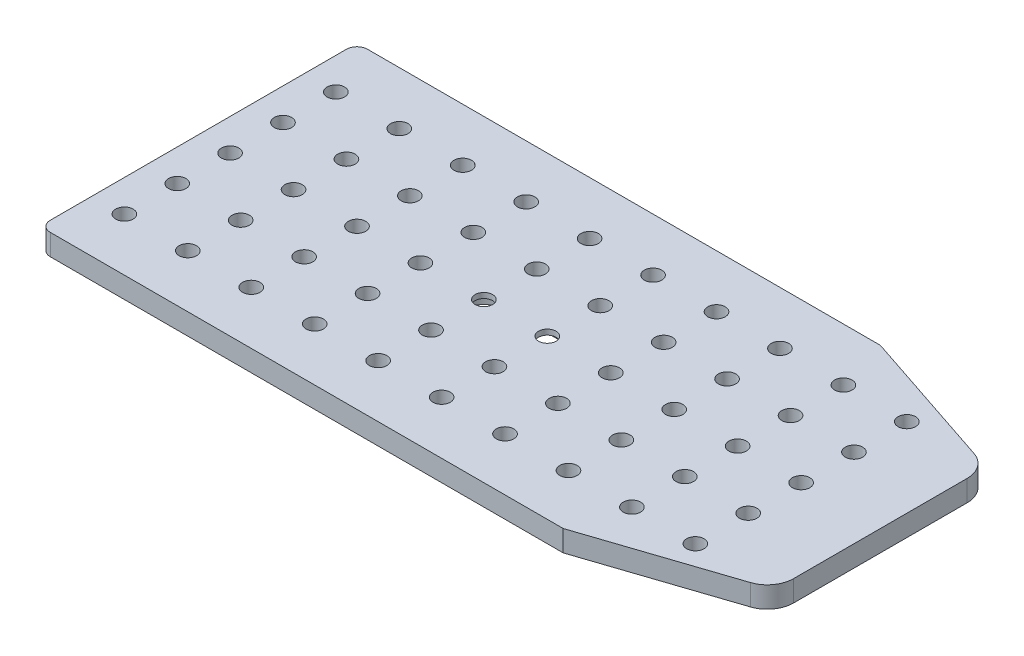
ISO-10303-21;
HEADER;
FILE_DESCRIPTION(('STEP AP214'),'2;1');
FILE_NAME('part.step','',(''),(''),'','','');
FILE_SCHEMA(('AUTOMOTIVE_DESIGN { 1 0 10303 214 1 1 1 1 }'));
ENDSEC;
DATA;
#1=APPLICATION_CONTEXT('core data for automotive mechanical design processes');
#2=APPLICATION_PROTOCOL_DEFINITION('international standard','automotive_design',2000,#1);
#3=PRODUCT_CONTEXT('',#1,'mechanical');
#4=PRODUCT('Part','Part','',(#3));
#5=PRODUCT_RELATED_PRODUCT_CATEGORY('part','',(#4));
#6=PRODUCT_DEFINITION_FORMATION('','',#4);
#7=PRODUCT_DEFINITION_CONTEXT('part definition',#1,'design');
#8=PRODUCT_DEFINITION('design','',#6,#7);
#9=PRODUCT_DEFINITION_SHAPE('','',#8);
#10=(LENGTH_UNIT() NAMED_UNIT(*) SI_UNIT(.MILLI.,.METRE.));
#11=(NAMED_UNIT(*) PLANE_ANGLE_UNIT() SI_UNIT($,.RADIAN.));
#12=(NAMED_UNIT(*) SI_UNIT($,.STERADIAN.) SOLID_ANGLE_UNIT());
#13=UNCERTAINTY_MEASURE_WITH_UNIT(LENGTH_MEASURE(1.E-05),#10,'distance_accuracy_value','');
#14=(GEOMETRIC_REPRESENTATION_CONTEXT(3) GLOBAL_UNCERTAINTY_ASSIGNED_CONTEXT((#13)) GLOBAL_UNIT_ASSIGNED_CONTEXT((#10,
#11,#12)) REPRESENTATION_CONTEXT('',''));
#15=CARTESIAN_POINT('',(0.,0.,0.));
#16=DIRECTION('',(0.,0.,1.));
#17=DIRECTION('',(1.,0.,0.));
#18=AXIS2_PLACEMENT_3D('',#15,#16,#17);
#19=CARTESIAN_POINT('',(42.0000000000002,0.,0.));
#20=DIRECTION('',(0.,1.,0.));
#21=DIRECTION('',(0.,0.,1.));
#22=AXIS2_PLACEMENT_3D('',#19,#20,#21);
#23=CYLINDRICAL_SURFACE('',#22,1.65);
#24=CARTESIAN_POINT('',(42.0000000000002,4.,0.));
#25=DIRECTION('',(0.,1.,0.));
#26=DIRECTION('',(0.,0.,1.));
#27=AXIS2_PLACEMENT_3D('',#24,#25,#26);
#28=CIRCLE('',#27,1.65);
#29=CARTESIAN_POINT('',(42.0000000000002,4.,1.64999999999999));
#30=VERTEX_POINT('',#29);
#31=EDGE_CURVE('E351',#30,#30,#28,.T.);
#32=ORIENTED_EDGE('',*,*,#31,.T.);
#33=EDGE_LOOP('',(#32));
#34=FACE_BOUND('',#33,.T.);
#35=CARTESIAN_POINT('',(42.0000000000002,3.,0.));
#36=DIRECTION('',(0.,-1.,0.));
#37=DIRECTION('',(0.,0.,-1.));
#38=AXIS2_PLACEMENT_3D('',#35,#36,#37);
#39=CIRCLE('',#38,1.65);
#40=CARTESIAN_POINT('',(42.0000000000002,3.,-1.65000000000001));
#41=VERTEX_POINT('',#40);
#42=EDGE_CURVE('E511',#41,#41,#39,.F.);
#43=ORIENTED_EDGE('',*,*,#42,.F.);
#44=EDGE_LOOP('',(#43));
#45=FACE_BOUND('',#44,.T.);
#46=ADVANCED_FACE('F47',(#34,#45),#23,.F.);
#47=CARTESIAN_POINT('',(30.0000000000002,0.,0.));
#48=DIRECTION('',(0.,1.,0.));
#49=DIRECTION('',(0.,0.,1.));
#50=AXIS2_PLACEMENT_3D('',#47,#48,#49);
#51=CYLINDRICAL_SURFACE('',#50,1.65);
#52=CARTESIAN_POINT('',(30.0000000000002,4.,0.));
#53=DIRECTION('',(0.,1.,0.));
#54=DIRECTION('',(0.,0.,1.));
#55=AXIS2_PLACEMENT_3D('',#52,#53,#54);
#56=CIRCLE('',#55,1.65);
#57=CARTESIAN_POINT('',(30.0000000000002,4.,1.64999999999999));
#58=VERTEX_POINT('',#57);
#59=EDGE_CURVE('E403',#58,#58,#56,.T.);
#60=ORIENTED_EDGE('',*,*,#59,.T.);
#61=EDGE_LOOP('',(#60));
#62=FACE_BOUND('',#61,.T.);
#63=CARTESIAN_POINT('',(30.0000000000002,3.,0.));
#64=DIRECTION('',(0.,-1.,0.));
#65=DIRECTION('',(0.,0.,-1.));
#66=AXIS2_PLACEMENT_3D('',#63,#64,#65);
#67=CIRCLE('',#66,1.65);
#68=CARTESIAN_POINT('',(30.0000000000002,3.,-1.65000000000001));
#69=VERTEX_POINT('',#68);
#70=EDGE_CURVE('E507',#69,#69,#67,.F.);
#71=ORIENTED_EDGE('',*,*,#70,.F.);
#72=EDGE_LOOP('',(#71));
#73=FACE_BOUND('',#72,.T.);
#74=ADVANCED_FACE('F553',(#62,#73),#51,.F.);
#75=CARTESIAN_POINT('',(0.,4.,0.));
#76=DIRECTION('',(0.,1.,0.));
#77=DIRECTION('',(0.,0.,1.));
#78=AXIS2_PLACEMENT_3D('',#75,#76,#77);
#79=PLANE('',#78);
#80=DIRECTION('',(-1.,0.,0.));
#81=VECTOR('',#80,1.);
#82=CARTESIAN_POINT('',(0.,4.,-30.));
#83=LINE('',#82,#81);
#84=CARTESIAN_POINT('',(75.,4.,-30.));
#85=VERTEX_POINT('',#84);
#86=CARTESIAN_POINT('',(-21.9999999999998,4.,-30.));
#87=VERTEX_POINT('',#86);
#88=EDGE_CURVE('E165',#85,#87,#83,.T.);
#89=ORIENTED_EDGE('',*,*,#88,.T.);
#90=CARTESIAN_POINT('',(-21.9999999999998,4.,-28.));
#91=DIRECTION('',(0.,1.,0.));
#92=DIRECTION('',(0.,0.,1.));
#93=AXIS2_PLACEMENT_3D('',#90,#91,#92);
#94=CIRCLE('',#93,2.);
#95=CARTESIAN_POINT('',(-23.9999999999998,4.,-28.));
#96=VERTEX_POINT('',#95);
#97=EDGE_CURVE('E56',#87,#96,#94,.T.);
#98=ORIENTED_EDGE('',*,*,#97,.T.);
#99=DIRECTION('',(0.,0.,-1.));
#100=VECTOR('',#99,1.);
#101=CARTESIAN_POINT('',(-23.9999999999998,4.,0.));
#102=LINE('',#101,#100);
#103=CARTESIAN_POINT('',(-23.9999999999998,4.,28.));
#104=VERTEX_POINT('',#103);
#105=EDGE_CURVE('E532',#104,#96,#102,.T.);
#106=ORIENTED_EDGE('',*,*,#105,.F.);
#107=CARTESIAN_POINT('',(-21.9999999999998,4.,28.));
#108=DIRECTION('',(0.,1.,0.));
#109=DIRECTION('',(0.,0.,1.));
#110=AXIS2_PLACEMENT_3D('',#107,#108,#109);
#111=CIRCLE('',#110,2.);
#112=CARTESIAN_POINT('',(-21.9999999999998,4.,30.));
#113=VERTEX_POINT('',#112);
#114=EDGE_CURVE('E63',#104,#113,#111,.T.);
#115=ORIENTED_EDGE('',*,*,#114,.T.);
#116=DIRECTION('',(-1.,0.,0.));
#117=VECTOR('',#116,1.);
#118=CARTESIAN_POINT('',(0.,4.,30.));
#119=LINE('',#118,#117);
#120=CARTESIAN_POINT('',(75.,4.,30.));
#121=VERTEX_POINT('',#120);
#122=EDGE_CURVE('E201',#121,#113,#119,.T.);
#123=ORIENTED_EDGE('',*,*,#122,.F.);
#124=DIRECTION('',(-0.948683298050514,0.,0.316227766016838));
#125=VECTOR('',#124,1.);
#126=CARTESIAN_POINT('',(16.5,4.,49.5));
#127=LINE('',#126,#125);
#128=CARTESIAN_POINT('',(101.581138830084,4.,21.1396203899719));
#129=VERTEX_POINT('',#128);
#130=EDGE_CURVE('E184',#129,#121,#127,.T.);
#131=ORIENTED_EDGE('',*,*,#130,.F.);
#132=CARTESIAN_POINT('',(100.,4.,16.3962038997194));
#133=DIRECTION('',(0.,1.,0.));
#134=DIRECTION('',(0.,0.,1.));
#135=AXIS2_PLACEMENT_3D('',#132,#133,#134);
#136=CIRCLE('',#135,5.);
#137=CARTESIAN_POINT('',(105.,4.,16.3962038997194));
#138=VERTEX_POINT('',#137);
#139=EDGE_CURVE('E488',#129,#138,#136,.T.);
#140=ORIENTED_EDGE('',*,*,#139,.T.);
#141=DIRECTION('',(0.,0.,1.));
#142=VECTOR('',#141,1.);
#143=CARTESIAN_POINT('',(105.,4.,0.));
#144=LINE('',#143,#142);
#145=CARTESIAN_POINT('',(105.,4.,-16.3962038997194));
#146=VERTEX_POINT('',#145);
#147=EDGE_CURVE('E188',#146,#138,#144,.T.);
#148=ORIENTED_EDGE('',*,*,#147,.F.);
#149=CARTESIAN_POINT('',(100.,4.,-16.3962038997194));
#150=DIRECTION('',(0.,1.,0.));
#151=DIRECTION('',(0.,0.,1.));
#152=AXIS2_PLACEMENT_3D('',#149,#150,#151);
#153=CIRCLE('',#152,5.);
#154=CARTESIAN_POINT('',(101.581138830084,4.,-21.1396203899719));
#155=VERTEX_POINT('',#154);
#156=EDGE_CURVE('E491',#146,#155,#153,.T.);
#157=ORIENTED_EDGE('',*,*,#156,.T.);
#158=DIRECTION('',(0.948683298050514,0.,0.316227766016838));
#159=VECTOR('',#158,1.);
#160=CARTESIAN_POINT('',(16.5,4.,-49.5));
#161=LINE('',#160,#159);
#162=EDGE_CURVE('E192',#85,#155,#161,.T.);
#163=ORIENTED_EDGE('',*,*,#162,.F.);
#164=EDGE_LOOP('',(#89,#98,#106,#115,#123,#131,#140,#148,#157,#163));
#165=FACE_BOUND('',#164,.T.);
#166=CARTESIAN_POINT('',(90.0000000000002,4.,0.));
#167=DIRECTION('',(0.,1.,0.));
#168=DIRECTION('',(0.,0.,1.));
#169=AXIS2_PLACEMENT_3D('',#166,#167,#168);
#170=CIRCLE('',#169,1.65);
#171=CARTESIAN_POINT('',(90.0000000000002,4.,1.65));
#172=VERTEX_POINT('',#171);
#173=EDGE_CURVE('E803',#172,#172,#170,.T.);
#174=ORIENTED_EDGE('',*,*,#173,.F.);
#175=EDGE_LOOP('',(#174));
#176=FACE_BOUND('',#175,.T.);
#177=CARTESIAN_POINT('',(66.0000000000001,4.,-20.));
#178=DIRECTION('',(0.,1.,0.));
#179=DIRECTION('',(0.,0.,1.));
#180=AXIS2_PLACEMENT_3D('',#177,#178,#179);
#181=CIRCLE('',#180,1.65);
#182=CARTESIAN_POINT('',(66.0000000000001,4.,-18.35));
#183=VERTEX_POINT('',#182);
#184=EDGE_CURVE('E795',#183,#183,#181,.T.);
#185=ORIENTED_EDGE('',*,*,#184,.F.);
#186=EDGE_LOOP('',(#185));
#187=FACE_BOUND('',#186,.T.);
#188=CARTESIAN_POINT('',(90.0000000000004,4.,20.));
#189=DIRECTION('',(0.,1.,0.));
#190=DIRECTION('',(0.,0.,1.));
#191=AXIS2_PLACEMENT_3D('',#188,#189,#190);
#192=CIRCLE('',#191,1.65);
#193=CARTESIAN_POINT('',(90.0000000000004,4.,21.65));
#194=VERTEX_POINT('',#193);
#195=EDGE_CURVE('E787',#194,#194,#192,.T.);
#196=ORIENTED_EDGE('',*,*,#195,.F.);
#197=EDGE_LOOP('',(#196));
#198=FACE_BOUND('',#197,.T.);
#199=CARTESIAN_POINT('',(90.0000000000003,4.,10.));
#200=DIRECTION('',(0.,1.,0.));
#201=DIRECTION('',(0.,0.,1.));
#202=AXIS2_PLACEMENT_3D('',#199,#200,#201);
#203=CIRCLE('',#202,1.65);
#204=CARTESIAN_POINT('',(90.0000000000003,4.,11.65));
#205=VERTEX_POINT('',#204);
#206=EDGE_CURVE('E778',#205,#205,#203,.T.);
#207=ORIENTED_EDGE('',*,*,#206,.F.);
#208=EDGE_LOOP('',(#207));
#209=FACE_BOUND('',#208,.T.);
#210=CARTESIAN_POINT('',(90.0000000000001,4.,-20.));
#211=DIRECTION('',(0.,1.,0.));
#212=DIRECTION('',(0.,0.,1.));
#213=AXIS2_PLACEMENT_3D('',#210,#211,#212);
#214=CIRCLE('',#213,1.65);
#215=CARTESIAN_POINT('',(90.0000000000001,4.,-18.35));
#216=VERTEX_POINT('',#215);
#217=EDGE_CURVE('E826',#216,#216,#214,.T.);
#218=ORIENTED_EDGE('',*,*,#217,.F.);
#219=EDGE_LOOP('',(#218));
#220=FACE_BOUND('',#219,.T.);
#221=CARTESIAN_POINT('',(66.0000000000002,4.,-10.));
#222=DIRECTION('',(0.,1.,0.));
#223=DIRECTION('',(0.,0.,1.));
#224=AXIS2_PLACEMENT_3D('',#221,#222,#223);
#225=CIRCLE('',#224,1.65);
#226=CARTESIAN_POINT('',(66.0000000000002,4.,-8.35));
#227=VERTEX_POINT('',#226);
#228=EDGE_CURVE('E835',#227,#227,#225,.T.);
#229=ORIENTED_EDGE('',*,*,#228,.F.);
#230=EDGE_LOOP('',(#229));
#231=FACE_BOUND('',#230,.T.);
#232=CARTESIAN_POINT('',(78.0000000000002,4.,-10.));
#233=DIRECTION('',(0.,1.,0.));
#234=DIRECTION('',(0.,0.,1.));
#235=AXIS2_PLACEMENT_3D('',#232,#233,#234);
#236=CIRCLE('',#235,1.65);
#237=CARTESIAN_POINT('',(78.0000000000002,4.,-8.35));
#238=VERTEX_POINT('',#237);
#239=EDGE_CURVE('E810',#238,#238,#236,.T.);
#240=ORIENTED_EDGE('',*,*,#239,.F.);
#241=EDGE_LOOP('',(#240));
#242=FACE_BOUND('',#241,.T.);
#243=CARTESIAN_POINT('',(90.0000000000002,4.,-10.));
#244=DIRECTION('',(0.,1.,0.));
#245=DIRECTION('',(0.,0.,1.));
#246=AXIS2_PLACEMENT_3D('',#243,#244,#245);
#247=CIRCLE('',#246,1.65);
#248=CARTESIAN_POINT('',(90.0000000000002,4.,-8.35));
#249=VERTEX_POINT('',#248);
#250=EDGE_CURVE('E819',#249,#249,#247,.T.);
#251=ORIENTED_EDGE('',*,*,#250,.F.);
#252=EDGE_LOOP('',(#251));
#253=FACE_BOUND('',#252,.T.);
#254=CARTESIAN_POINT('',(78.0000000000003,4.,10.));
#255=DIRECTION('',(0.,1.,0.));
#256=DIRECTION('',(0.,0.,1.));
#257=AXIS2_PLACEMENT_3D('',#254,#255,#256);
#258=CIRCLE('',#257,1.65);
#259=CARTESIAN_POINT('',(78.0000000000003,4.,11.65));
#260=VERTEX_POINT('',#259);
#261=EDGE_CURVE('E739',#260,#260,#258,.T.);
#262=ORIENTED_EDGE('',*,*,#261,.F.);
#263=EDGE_LOOP('',(#262));
#264=FACE_BOUND('',#263,.T.);
#265=CARTESIAN_POINT('',(78.0000000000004,4.,20.));
#266=DIRECTION('',(0.,1.,0.));
#267=DIRECTION('',(0.,0.,1.));
#268=AXIS2_PLACEMENT_3D('',#265,#266,#267);
#269=CIRCLE('',#268,1.65);
#270=CARTESIAN_POINT('',(78.0000000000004,4.,21.65));
#271=VERTEX_POINT('',#270);
#272=EDGE_CURVE('E730',#271,#271,#269,.T.);
#273=ORIENTED_EDGE('',*,*,#272,.F.);
#274=EDGE_LOOP('',(#273));
#275=FACE_BOUND('',#274,.T.);
#276=CARTESIAN_POINT('',(66.0000000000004,4.,20.));
#277=DIRECTION('',(0.,1.,0.));
#278=DIRECTION('',(0.,0.,1.));
#279=AXIS2_PLACEMENT_3D('',#276,#277,#278);
#280=CIRCLE('',#279,1.65);
#281=CARTESIAN_POINT('',(66.0000000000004,4.,21.65));
#282=VERTEX_POINT('',#281);
#283=EDGE_CURVE('E771',#282,#282,#280,.T.);
#284=ORIENTED_EDGE('',*,*,#283,.F.);
#285=EDGE_LOOP('',(#284));
#286=FACE_BOUND('',#285,.T.);
#287=CARTESIAN_POINT('',(66.0000000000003,4.,10.));
#288=DIRECTION('',(0.,1.,0.));
#289=DIRECTION('',(0.,0.,1.));
#290=AXIS2_PLACEMENT_3D('',#287,#288,#289);
#291=CIRCLE('',#290,1.65);
#292=CARTESIAN_POINT('',(66.0000000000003,4.,11.65));
#293=VERTEX_POINT('',#292);
#294=EDGE_CURVE('E763',#293,#293,#291,.T.);
#295=ORIENTED_EDGE('',*,*,#294,.F.);
#296=EDGE_LOOP('',(#295));
#297=FACE_BOUND('',#296,.T.);
#298=CARTESIAN_POINT('',(66.0000000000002,4.,0.));
#299=DIRECTION('',(0.,1.,0.));
#300=DIRECTION('',(0.,0.,1.));
#301=AXIS2_PLACEMENT_3D('',#298,#299,#300);
#302=CIRCLE('',#301,1.65);
#303=CARTESIAN_POINT('',(66.0000000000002,4.,1.65));
#304=VERTEX_POINT('',#303);
#305=EDGE_CURVE('E755',#304,#304,#302,.T.);
#306=ORIENTED_EDGE('',*,*,#305,.F.);
#307=EDGE_LOOP('',(#306));
#308=FACE_BOUND('',#307,.T.);
#309=CARTESIAN_POINT('',(78.0000000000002,4.,0.));
#310=DIRECTION('',(0.,1.,0.));
#311=DIRECTION('',(0.,0.,1.));
#312=AXIS2_PLACEMENT_3D('',#309,#310,#311);
#313=CIRCLE('',#312,1.65);
#314=CARTESIAN_POINT('',(78.0000000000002,4.,1.65));
#315=VERTEX_POINT('',#314);
#316=EDGE_CURVE('E746',#315,#315,#313,.T.);
#317=ORIENTED_EDGE('',*,*,#316,.F.);
#318=EDGE_LOOP('',(#317));
#319=FACE_BOUND('',#318,.T.);
#320=CARTESIAN_POINT('',(78.0000000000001,4.,-20.));
#321=DIRECTION('',(0.,1.,0.));
#322=DIRECTION('',(0.,0.,1.));
#323=AXIS2_PLACEMENT_3D('',#320,#321,#322);
#324=CIRCLE('',#323,1.65);
#325=CARTESIAN_POINT('',(78.0000000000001,4.,-18.35));
#326=VERTEX_POINT('',#325);
#327=EDGE_CURVE('E830',#326,#326,#324,.T.);
#328=ORIENTED_EDGE('',*,*,#327,.F.);
#329=EDGE_LOOP('',(#328));
#330=FACE_BOUND('',#329,.T.);
#331=CARTESIAN_POINT('',(30.,4.,-20.));
#332=DIRECTION('',(0.,1.,0.));
#333=DIRECTION('',(0.,0.,1.));
#334=AXIS2_PLACEMENT_3D('',#331,#332,#333);
#335=CIRCLE('',#334,1.65);
#336=CARTESIAN_POINT('',(30.,4.,-18.35));
#337=VERTEX_POINT('',#336);
#338=EDGE_CURVE('E475',#337,#337,#335,.T.);
#339=ORIENTED_EDGE('',*,*,#338,.F.);
#340=EDGE_LOOP('',(#339));
#341=FACE_BOUND('',#340,.T.);
#342=CARTESIAN_POINT('',(54.,4.,-20.));
#343=DIRECTION('',(0.,1.,0.));
#344=DIRECTION('',(0.,0.,1.));
#345=AXIS2_PLACEMENT_3D('',#342,#343,#344);
#346=CIRCLE('',#345,1.65);
#347=CARTESIAN_POINT('',(54.,4.,-18.35));
#348=VERTEX_POINT('',#347);
#349=EDGE_CURVE('E471',#348,#348,#346,.T.);
#350=ORIENTED_EDGE('',*,*,#349,.F.);
#351=EDGE_LOOP('',(#350));
#352=FACE_BOUND('',#351,.T.);
#353=CARTESIAN_POINT('',(6.0000000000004,4.,20.));
#354=DIRECTION('',(0.,1.,0.));
#355=DIRECTION('',(0.,0.,1.));
#356=AXIS2_PLACEMENT_3D('',#353,#354,#355);
#357=CIRCLE('',#356,1.65);
#358=CARTESIAN_POINT('',(6.0000000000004,4.,21.65));
#359=VERTEX_POINT('',#358);
#360=EDGE_CURVE('E467',#359,#359,#357,.T.);
#361=ORIENTED_EDGE('',*,*,#360,.F.);
#362=EDGE_LOOP('',(#361));
#363=FACE_BOUND('',#362,.T.);
#364=CARTESIAN_POINT('',(42.,4.,-20.));
#365=DIRECTION('',(0.,1.,0.));
#366=DIRECTION('',(0.,0.,1.));
#367=AXIS2_PLACEMENT_3D('',#364,#365,#366);
#368=CIRCLE('',#367,1.65);
#369=CARTESIAN_POINT('',(42.,4.,-18.35));
#370=VERTEX_POINT('',#369);
#371=EDGE_CURVE('E463',#370,#370,#368,.T.);
#372=ORIENTED_EDGE('',*,*,#371,.F.);
#373=EDGE_LOOP('',(#372));
#374=FACE_BOUND('',#373,.T.);
#375=CARTESIAN_POINT('',(6.00000000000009,4.,-10.));
#376=DIRECTION('',(0.,1.,0.));
#377=DIRECTION('',(0.,0.,1.));
#378=AXIS2_PLACEMENT_3D('',#375,#376,#377);
#379=CIRCLE('',#378,1.65);
#380=CARTESIAN_POINT('',(6.00000000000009,4.,-8.35000000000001));
#381=VERTEX_POINT('',#380);
#382=EDGE_CURVE('E459',#381,#381,#379,.T.);
#383=ORIENTED_EDGE('',*,*,#382,.F.);
#384=EDGE_LOOP('',(#383));
#385=FACE_BOUND('',#384,.T.);
#386=CARTESIAN_POINT('',(18.0000000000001,4.,-10.));
#387=DIRECTION('',(0.,1.,0.));
#388=DIRECTION('',(0.,0.,1.));
#389=AXIS2_PLACEMENT_3D('',#386,#387,#388);
#390=CIRCLE('',#389,1.65);
#391=CARTESIAN_POINT('',(18.0000000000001,4.,-8.35000000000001));
#392=VERTEX_POINT('',#391);
#393=EDGE_CURVE('E455',#392,#392,#390,.T.);
#394=ORIENTED_EDGE('',*,*,#393,.F.);
#395=EDGE_LOOP('',(#394));
#396=FACE_BOUND('',#395,.T.);
#397=CARTESIAN_POINT('',(18.,4.,-20.));
#398=DIRECTION('',(0.,1.,0.));
#399=DIRECTION('',(0.,0.,1.));
#400=AXIS2_PLACEMENT_3D('',#397,#398,#399);
#401=CIRCLE('',#400,1.65);
#402=CARTESIAN_POINT('',(18.,4.,-18.35));
#403=VERTEX_POINT('',#402);
#404=EDGE_CURVE('E451',#403,#403,#401,.T.);
#405=ORIENTED_EDGE('',*,*,#404,.F.);
#406=EDGE_LOOP('',(#405));
#407=FACE_BOUND('',#406,.T.);
#408=CARTESIAN_POINT('',(-5.99999999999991,4.,-10.));
#409=DIRECTION('',(0.,1.,0.));
#410=DIRECTION('',(0.,0.,1.));
#411=AXIS2_PLACEMENT_3D('',#408,#409,#410);
#412=CIRCLE('',#411,1.65);
#413=CARTESIAN_POINT('',(-5.99999999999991,4.,-8.35000000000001));
#414=VERTEX_POINT('',#413);
#415=EDGE_CURVE('E447',#414,#414,#412,.T.);
#416=ORIENTED_EDGE('',*,*,#415,.F.);
#417=EDGE_LOOP('',(#416));
#418=FACE_BOUND('',#417,.T.);
#419=CARTESIAN_POINT('',(-18.,4.,-20.));
#420=DIRECTION('',(0.,1.,0.));
#421=DIRECTION('',(0.,0.,1.));
#422=AXIS2_PLACEMENT_3D('',#419,#420,#421);
#423=CIRCLE('',#422,1.65);
#424=CARTESIAN_POINT('',(-18.,4.,-18.35));
#425=VERTEX_POINT('',#424);
#426=EDGE_CURVE('E443',#425,#425,#423,.T.);
#427=ORIENTED_EDGE('',*,*,#426,.F.);
#428=EDGE_LOOP('',(#427));
#429=FACE_BOUND('',#428,.T.);
#430=CARTESIAN_POINT('',(-17.9999999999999,4.,-10.));
#431=DIRECTION('',(0.,1.,0.));
#432=DIRECTION('',(0.,0.,1.));
#433=AXIS2_PLACEMENT_3D('',#430,#431,#432);
#434=CIRCLE('',#433,1.65);
#435=CARTESIAN_POINT('',(-17.9999999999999,4.,-8.35000000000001));
#436=VERTEX_POINT('',#435);
#437=EDGE_CURVE('E439',#436,#436,#434,.T.);
#438=ORIENTED_EDGE('',*,*,#437,.F.);
#439=EDGE_LOOP('',(#438));
#440=FACE_BOUND('',#439,.T.);
#441=CARTESIAN_POINT('',(5.99999999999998,4.,-20.));
#442=DIRECTION('',(0.,1.,0.));
#443=DIRECTION('',(0.,0.,1.));
#444=AXIS2_PLACEMENT_3D('',#441,#442,#443);
#445=CIRCLE('',#444,1.65);
#446=CARTESIAN_POINT('',(5.99999999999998,4.,-18.35));
#447=VERTEX_POINT('',#446);
#448=EDGE_CURVE('E435',#447,#447,#445,.T.);
#449=ORIENTED_EDGE('',*,*,#448,.F.);
#450=EDGE_LOOP('',(#449));
#451=FACE_BOUND('',#450,.T.);
#452=CARTESIAN_POINT('',(-6.00000000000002,4.,-20.));
#453=DIRECTION('',(0.,1.,0.));
#454=DIRECTION('',(0.,0.,1.));
#455=AXIS2_PLACEMENT_3D('',#452,#453,#454);
#456=CIRCLE('',#455,1.65);
#457=CARTESIAN_POINT('',(-6.00000000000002,4.,-18.35));
#458=VERTEX_POINT('',#457);
#459=EDGE_CURVE('E431',#458,#458,#456,.T.);
#460=ORIENTED_EDGE('',*,*,#459,.F.);
#461=EDGE_LOOP('',(#460));
#462=FACE_BOUND('',#461,.T.);
#463=CARTESIAN_POINT('',(-17.9999999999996,4.,20.));
#464=DIRECTION('',(0.,1.,0.));
#465=DIRECTION('',(0.,0.,1.));
#466=AXIS2_PLACEMENT_3D('',#463,#464,#465);
#467=CIRCLE('',#466,1.65);
#468=CARTESIAN_POINT('',(-17.9999999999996,4.,21.65));
#469=VERTEX_POINT('',#468);
#470=EDGE_CURVE('E427',#469,#469,#467,.T.);
#471=ORIENTED_EDGE('',*,*,#470,.F.);
#472=EDGE_LOOP('',(#471));
#473=FACE_BOUND('',#472,.T.);
#474=CARTESIAN_POINT('',(-17.9999999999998,4.,0.));
#475=DIRECTION('',(0.,1.,0.));
#476=DIRECTION('',(0.,0.,1.));
#477=AXIS2_PLACEMENT_3D('',#474,#475,#476);
#478=CIRCLE('',#477,1.65);
#479=CARTESIAN_POINT('',(-17.9999999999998,4.,1.64999999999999));
#480=VERTEX_POINT('',#479);
#481=EDGE_CURVE('E423',#480,#480,#478,.T.);
#482=ORIENTED_EDGE('',*,*,#481,.F.);
#483=EDGE_LOOP('',(#482));
#484=FACE_BOUND('',#483,.T.);
#485=CARTESIAN_POINT('',(-17.9999999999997,4.,9.99999999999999));
#486=DIRECTION('',(0.,1.,0.));
#487=DIRECTION('',(0.,0.,1.));
#488=AXIS2_PLACEMENT_3D('',#485,#486,#487);
#489=CIRCLE('',#488,1.65);
#490=CARTESIAN_POINT('',(-17.9999999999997,4.,11.65));
#491=VERTEX_POINT('',#490);
#492=EDGE_CURVE('E419',#491,#491,#489,.T.);
#493=ORIENTED_EDGE('',*,*,#492,.F.);
#494=EDGE_LOOP('',(#493));
#495=FACE_BOUND('',#494,.T.);
#496=CARTESIAN_POINT('',(-5.9999999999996,4.,20.));
#497=DIRECTION('',(0.,1.,0.));
#498=DIRECTION('',(0.,0.,1.));
#499=AXIS2_PLACEMENT_3D('',#496,#497,#498);
#500=CIRCLE('',#499,1.65);
#501=CARTESIAN_POINT('',(-5.9999999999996,4.,21.65));
#502=VERTEX_POINT('',#501);
#503=EDGE_CURVE('E415',#502,#502,#500,.T.);
#504=ORIENTED_EDGE('',*,*,#503,.F.);
#505=EDGE_LOOP('',(#504));
#506=FACE_BOUND('',#505,.T.);
#507=CARTESIAN_POINT('',(6.00000000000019,4.,0.));
#508=DIRECTION('',(0.,1.,0.));
#509=DIRECTION('',(0.,0.,1.));
#510=AXIS2_PLACEMENT_3D('',#507,#508,#509);
#511=CIRCLE('',#510,1.65);
#512=CARTESIAN_POINT('',(6.00000000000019,4.,1.64999999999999));
#513=VERTEX_POINT('',#512);
#514=EDGE_CURVE('E411',#513,#513,#511,.T.);
#515=ORIENTED_EDGE('',*,*,#514,.F.);
#516=EDGE_LOOP('',(#515));
#517=FACE_BOUND('',#516,.T.);
#518=CARTESIAN_POINT('',(-5.99999999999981,4.,0.));
#519=DIRECTION('',(0.,1.,0.));
#520=DIRECTION('',(0.,0.,1.));
#521=AXIS2_PLACEMENT_3D('',#518,#519,#520);
#522=CIRCLE('',#521,1.65);
#523=CARTESIAN_POINT('',(-5.99999999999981,4.,1.64999999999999));
#524=VERTEX_POINT('',#523);
#525=EDGE_CURVE('E407',#524,#524,#522,.T.);
#526=ORIENTED_EDGE('',*,*,#525,.F.);
#527=EDGE_LOOP('',(#526));
#528=FACE_BOUND('',#527,.T.);
#529=ORIENTED_EDGE('',*,*,#59,.F.);
#530=EDGE_LOOP('',(#529));
#531=FACE_BOUND('',#530,.T.);
#532=CARTESIAN_POINT('',(30.0000000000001,4.,-10.));
#533=DIRECTION('',(0.,1.,0.));
#534=DIRECTION('',(0.,0.,1.));
#535=AXIS2_PLACEMENT_3D('',#532,#533,#534);
#536=CIRCLE('',#535,1.65);
#537=CARTESIAN_POINT('',(30.0000000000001,4.,-8.35000000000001));
#538=VERTEX_POINT('',#537);
#539=EDGE_CURVE('E399',#538,#538,#536,.T.);
#540=ORIENTED_EDGE('',*,*,#539,.F.);
#541=EDGE_LOOP('',(#540));
#542=FACE_BOUND('',#541,.T.);
#543=CARTESIAN_POINT('',(54.0000000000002,4.,0.));
#544=DIRECTION('',(0.,1.,0.));
#545=DIRECTION('',(0.,0.,1.));
#546=AXIS2_PLACEMENT_3D('',#543,#544,#545);
#547=CIRCLE('',#546,1.65);
#548=CARTESIAN_POINT('',(54.0000000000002,4.,1.64999999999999));
#549=VERTEX_POINT('',#548);
#550=EDGE_CURVE('E395',#549,#549,#547,.T.);
#551=ORIENTED_EDGE('',*,*,#550,.F.);
#552=EDGE_LOOP('',(#551));
#553=FACE_BOUND('',#552,.T.);
#554=CARTESIAN_POINT('',(54.0000000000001,4.,-10.));
#555=DIRECTION('',(0.,1.,0.));
#556=DIRECTION('',(0.,0.,1.));
#557=AXIS2_PLACEMENT_3D('',#554,#555,#556);
#558=CIRCLE('',#557,1.65);
#559=CARTESIAN_POINT('',(54.0000000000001,4.,-8.35000000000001));
#560=VERTEX_POINT('',#559);
#561=EDGE_CURVE('E391',#560,#560,#558,.T.);
#562=ORIENTED_EDGE('',*,*,#561,.F.);
#563=EDGE_LOOP('',(#562));
#564=FACE_BOUND('',#563,.T.);
#565=CARTESIAN_POINT('',(-5.99999999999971,4.,9.99999999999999));
#566=DIRECTION('',(0.,1.,0.));
#567=DIRECTION('',(0.,0.,1.));
#568=AXIS2_PLACEMENT_3D('',#565,#566,#567);
#569=CIRCLE('',#568,1.65);
#570=CARTESIAN_POINT('',(-5.99999999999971,4.,11.65));
#571=VERTEX_POINT('',#570);
#572=EDGE_CURVE('E387',#571,#571,#569,.T.);
#573=ORIENTED_EDGE('',*,*,#572,.F.);
#574=EDGE_LOOP('',(#573));
#575=FACE_BOUND('',#574,.T.);
#576=CARTESIAN_POINT('',(30.0000000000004,4.,20.));
#577=DIRECTION('',(0.,1.,0.));
#578=DIRECTION('',(0.,0.,1.));
#579=AXIS2_PLACEMENT_3D('',#576,#577,#578);
#580=CIRCLE('',#579,1.65);
#581=CARTESIAN_POINT('',(30.0000000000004,4.,21.65));
#582=VERTEX_POINT('',#581);
#583=EDGE_CURVE('E383',#582,#582,#580,.T.);
#584=ORIENTED_EDGE('',*,*,#583,.F.);
#585=EDGE_LOOP('',(#584));
#586=FACE_BOUND('',#585,.T.);
#587=CARTESIAN_POINT('',(18.0000000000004,4.,20.));
#588=DIRECTION('',(0.,1.,0.));
#589=DIRECTION('',(0.,0.,1.));
#590=AXIS2_PLACEMENT_3D('',#587,#588,#589);
#591=CIRCLE('',#590,1.65);
#592=CARTESIAN_POINT('',(18.0000000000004,4.,21.65));
#593=VERTEX_POINT('',#592);
#594=EDGE_CURVE('E379',#593,#593,#591,.T.);
#595=ORIENTED_EDGE('',*,*,#594,.F.);
#596=EDGE_LOOP('',(#595));
#597=FACE_BOUND('',#596,.T.);
#598=CARTESIAN_POINT('',(30.0000000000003,4.,9.99999999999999));
#599=DIRECTION('',(0.,1.,0.));
#600=DIRECTION('',(0.,0.,1.));
#601=AXIS2_PLACEMENT_3D('',#598,#599,#600);
#602=CIRCLE('',#601,1.65);
#603=CARTESIAN_POINT('',(30.0000000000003,4.,11.65));
#604=VERTEX_POINT('',#603);
#605=EDGE_CURVE('E375',#604,#604,#602,.T.);
#606=ORIENTED_EDGE('',*,*,#605,.F.);
#607=EDGE_LOOP('',(#606));
#608=FACE_BOUND('',#607,.T.);
#609=CARTESIAN_POINT('',(42.0000000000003,4.,9.99999999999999));
#610=DIRECTION('',(0.,1.,0.));
#611=DIRECTION('',(0.,0.,1.));
#612=AXIS2_PLACEMENT_3D('',#609,#610,#611);
#613=CIRCLE('',#612,1.65);
#614=CARTESIAN_POINT('',(42.0000000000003,4.,11.65));
#615=VERTEX_POINT('',#614);
#616=EDGE_CURVE('E371',#615,#615,#613,.T.);
#617=ORIENTED_EDGE('',*,*,#616,.F.);
#618=EDGE_LOOP('',(#617));
#619=FACE_BOUND('',#618,.T.);
#620=CARTESIAN_POINT('',(6.0000000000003,4.,9.99999999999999));
#621=DIRECTION('',(0.,1.,0.));
#622=DIRECTION('',(0.,0.,1.));
#623=AXIS2_PLACEMENT_3D('',#620,#621,#622);
#624=CIRCLE('',#623,1.65);
#625=CARTESIAN_POINT('',(6.0000000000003,4.,11.65));
#626=VERTEX_POINT('',#625);
#627=EDGE_CURVE('E367',#626,#626,#624,.T.);
#628=ORIENTED_EDGE('',*,*,#627,.F.);
#629=EDGE_LOOP('',(#628));
#630=FACE_BOUND('',#629,.T.);
#631=CARTESIAN_POINT('',(18.0000000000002,4.,0.));
#632=DIRECTION('',(0.,1.,0.));
#633=DIRECTION('',(0.,0.,1.));
#634=AXIS2_PLACEMENT_3D('',#631,#632,#633);
#635=CIRCLE('',#634,1.65);
#636=CARTESIAN_POINT('',(18.0000000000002,4.,1.64999999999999));
#637=VERTEX_POINT('',#636);
#638=EDGE_CURVE('E363',#637,#637,#635,.T.);
#639=ORIENTED_EDGE('',*,*,#638,.F.);
#640=EDGE_LOOP('',(#639));
#641=FACE_BOUND('',#640,.T.);
#642=CARTESIAN_POINT('',(18.0000000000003,4.,9.99999999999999));
#643=DIRECTION('',(0.,1.,0.));
#644=DIRECTION('',(0.,0.,1.));
#645=AXIS2_PLACEMENT_3D('',#642,#643,#644);
#646=CIRCLE('',#645,1.65);
#647=CARTESIAN_POINT('',(18.0000000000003,4.,11.65));
#648=VERTEX_POINT('',#647);
#649=EDGE_CURVE('E359',#648,#648,#646,.T.);
#650=ORIENTED_EDGE('',*,*,#649,.F.);
#651=EDGE_LOOP('',(#650));
#652=FACE_BOUND('',#651,.T.);
#653=CARTESIAN_POINT('',(54.0000000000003,4.,9.99999999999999));
#654=DIRECTION('',(0.,1.,0.));
#655=DIRECTION('',(0.,0.,1.));
#656=AXIS2_PLACEMENT_3D('',#653,#654,#655);
#657=CIRCLE('',#656,1.65);
#658=CARTESIAN_POINT('',(54.0000000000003,4.,11.65));
#659=VERTEX_POINT('',#658);
#660=EDGE_CURVE('E355',#659,#659,#657,.T.);
#661=ORIENTED_EDGE('',*,*,#660,.F.);
#662=EDGE_LOOP('',(#661));
#663=FACE_BOUND('',#662,.T.);
#664=ORIENTED_EDGE('',*,*,#31,.F.);
#665=EDGE_LOOP('',(#664));
#666=FACE_BOUND('',#665,.T.);
#667=CARTESIAN_POINT('',(42.0000000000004,4.,20.));
#668=DIRECTION('',(0.,1.,0.));
#669=DIRECTION('',(0.,0.,1.));
#670=AXIS2_PLACEMENT_3D('',#667,#668,#669);
#671=CIRCLE('',#670,1.65);
#672=CARTESIAN_POINT('',(42.0000000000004,4.,21.65));
#673=VERTEX_POINT('',#672);
#674=EDGE_CURVE('E347',#673,#673,#671,.T.);
#675=ORIENTED_EDGE('',*,*,#674,.F.);
#676=EDGE_LOOP('',(#675));
#677=FACE_BOUND('',#676,.T.);
#678=CARTESIAN_POINT('',(42.0000000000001,4.,-10.));
#679=DIRECTION('',(0.,1.,0.));
#680=DIRECTION('',(0.,0.,1.));
#681=AXIS2_PLACEMENT_3D('',#678,#679,#680);
#682=CIRCLE('',#681,1.65);
#683=CARTESIAN_POINT('',(42.0000000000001,4.,-8.35000000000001));
#684=VERTEX_POINT('',#683);
#685=EDGE_CURVE('E343',#684,#684,#682,.T.);
#686=ORIENTED_EDGE('',*,*,#685,.F.);
#687=EDGE_LOOP('',(#686));
#688=FACE_BOUND('',#687,.T.);
#689=CARTESIAN_POINT('',(54.0000000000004,4.,20.));
#690=DIRECTION('',(0.,1.,0.));
#691=DIRECTION('',(0.,0.,1.));
#692=AXIS2_PLACEMENT_3D('',#689,#690,#691);
#693=CIRCLE('',#692,1.65);
#694=CARTESIAN_POINT('',(54.0000000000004,4.,21.65));
#695=VERTEX_POINT('',#694);
#696=EDGE_CURVE('E300',#695,#695,#693,.T.);
#697=ORIENTED_EDGE('',*,*,#696,.F.);
#698=EDGE_LOOP('',(#697));
#699=FACE_BOUND('',#698,.T.);
#700=ADVANCED_FACE('F530',(#165,#176,#187,#198,#209,#220,#231,#242,#253,#264,#275,#286,#297,
#308,#319,#330,#341,#352,#363,#374,#385,#396,#407,#418,#429,#440,#451,#462,#473,#484,#495,#506,
#517,#528,#531,#542,#553,#564,#575,#586,#597,#608,#619,#630,#641,#652,#663,#666,#677,#688,#699),
#79,.T.);
#701=CARTESIAN_POINT('',(0.,0.,0.));
#702=DIRECTION('',(0.,1.,0.));
#703=DIRECTION('',(0.,0.,1.));
#704=AXIS2_PLACEMENT_3D('',#701,#702,#703);
#705=PLANE('',#704);
#706=DIRECTION('',(1.,0.,0.));
#707=VECTOR('',#706,1.);
#708=CARTESIAN_POINT('',(30.0000000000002,0.,-4.5));
#709=LINE('',#708,#707);
#710=CARTESIAN_POINT('',(30.0000000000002,0.,-4.5));
#711=VERTEX_POINT('',#710);
#712=CARTESIAN_POINT('',(42.0000000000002,0.,-4.50000000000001));
#713=VERTEX_POINT('',#712);
#714=EDGE_CURVE('E684',#711,#713,#709,.T.);
#715=ORIENTED_EDGE('',*,*,#714,.F.);
#716=CARTESIAN_POINT('',(30.0000000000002,0.,0.));
#717=DIRECTION('',(0.,-1.,0.));
#718=DIRECTION('',(0.,0.,-1.));
#719=AXIS2_PLACEMENT_3D('',#716,#717,#718);
#720=CIRCLE('',#719,4.5);
#721=CARTESIAN_POINT('',(30.0000000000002,0.,4.5));
#722=VERTEX_POINT('',#721);
#723=EDGE_CURVE('E681',#722,#711,#720,.T.);
#724=ORIENTED_EDGE('',*,*,#723,.F.);
#725=DIRECTION('',(-1.,0.,0.));
#726=VECTOR('',#725,1.);
#727=CARTESIAN_POINT('',(30.0000000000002,0.,4.5));
#728=LINE('',#727,#726);
#729=CARTESIAN_POINT('',(42.0000000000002,0.,4.5));
#730=VERTEX_POINT('',#729);
#731=EDGE_CURVE('E692',#730,#722,#728,.T.);
#732=ORIENTED_EDGE('',*,*,#731,.F.);
#733=CARTESIAN_POINT('',(42.0000000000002,0.,0.));
#734=DIRECTION('',(0.,-1.,0.));
#735=DIRECTION('',(0.,0.,-1.));
#736=AXIS2_PLACEMENT_3D('',#733,#734,#735);
#737=CIRCLE('',#736,4.5);
#738=EDGE_CURVE('E708',#713,#730,#737,.T.);
#739=ORIENTED_EDGE('',*,*,#738,.F.);
#740=EDGE_LOOP('',(#715,#724,#732,#739));
#741=FACE_BOUND('',#740,.T.);
#742=CARTESIAN_POINT('',(54.0000000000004,0.,20.));
#743=DIRECTION('',(0.,1.,0.));
#744=DIRECTION('',(0.,0.,1.));
#745=AXIS2_PLACEMENT_3D('',#742,#743,#744);
#746=CIRCLE('',#745,1.65);
#747=CARTESIAN_POINT('',(54.0000000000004,0.,21.65));
#748=VERTEX_POINT('',#747);
#749=EDGE_CURVE('E259',#748,#748,#746,.T.);
#750=ORIENTED_EDGE('',*,*,#749,.T.);
#751=EDGE_LOOP('',(#750));
#752=FACE_BOUND('',#751,.T.);
#753=CARTESIAN_POINT('',(42.0000000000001,0.,-10.));
#754=DIRECTION('',(0.,1.,0.));
#755=DIRECTION('',(0.,0.,1.));
#756=AXIS2_PLACEMENT_3D('',#753,#754,#755);
#757=CIRCLE('',#756,1.65);
#758=CARTESIAN_POINT('',(42.0000000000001,0.,-8.35000000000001));
#759=VERTEX_POINT('',#758);
#760=EDGE_CURVE('E244',#759,#759,#757,.T.);
#761=ORIENTED_EDGE('',*,*,#760,.T.);
#762=EDGE_LOOP('',(#761));
#763=FACE_BOUND('',#762,.T.);
#764=CARTESIAN_POINT('',(42.0000000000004,0.,20.));
#765=DIRECTION('',(0.,1.,0.));
#766=DIRECTION('',(0.,0.,1.));
#767=AXIS2_PLACEMENT_3D('',#764,#765,#766);
#768=CIRCLE('',#767,1.65);
#769=CARTESIAN_POINT('',(42.0000000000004,0.,21.65));
#770=VERTEX_POINT('',#769);
#771=EDGE_CURVE('E248',#770,#770,#768,.T.);
#772=ORIENTED_EDGE('',*,*,#771,.T.);
#773=EDGE_LOOP('',(#772));
#774=FACE_BOUND('',#773,.T.);
#775=CARTESIAN_POINT('',(54.0000000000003,0.,9.99999999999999));
#776=DIRECTION('',(0.,1.,0.));
#777=DIRECTION('',(0.,0.,1.));
#778=AXIS2_PLACEMENT_3D('',#775,#776,#777);
#779=CIRCLE('',#778,1.65);
#780=CARTESIAN_POINT('',(54.0000000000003,0.,11.65));
#781=VERTEX_POINT('',#780);
#782=EDGE_CURVE('E252',#781,#781,#779,.T.);
#783=ORIENTED_EDGE('',*,*,#782,.T.);
#784=EDGE_LOOP('',(#783));
#785=FACE_BOUND('',#784,.T.);
#786=CARTESIAN_POINT('',(18.0000000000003,0.,9.99999999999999));
#787=DIRECTION('',(0.,1.,0.));
#788=DIRECTION('',(0.,0.,1.));
#789=AXIS2_PLACEMENT_3D('',#786,#787,#788);
#790=CIRCLE('',#789,1.65);
#791=CARTESIAN_POINT('',(18.0000000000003,0.,11.65));
#792=VERTEX_POINT('',#791);
#793=EDGE_CURVE('E267',#792,#792,#790,.T.);
#794=ORIENTED_EDGE('',*,*,#793,.T.);
#795=EDGE_LOOP('',(#794));
#796=FACE_BOUND('',#795,.T.);
#797=CARTESIAN_POINT('',(18.0000000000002,0.,0.));
#798=DIRECTION('',(0.,1.,0.));
#799=DIRECTION('',(0.,0.,1.));
#800=AXIS2_PLACEMENT_3D('',#797,#798,#799);
#801=CIRCLE('',#800,1.65);
#802=CARTESIAN_POINT('',(18.0000000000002,0.,1.64999999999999));
#803=VERTEX_POINT('',#802);
#804=EDGE_CURVE('E271',#803,#803,#801,.T.);
#805=ORIENTED_EDGE('',*,*,#804,.T.);
#806=EDGE_LOOP('',(#805));
#807=FACE_BOUND('',#806,.T.);
#808=CARTESIAN_POINT('',(6.0000000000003,0.,9.99999999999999));
#809=DIRECTION('',(0.,1.,0.));
#810=DIRECTION('',(0.,0.,1.));
#811=AXIS2_PLACEMENT_3D('',#808,#809,#810);
#812=CIRCLE('',#811,1.65);
#813=CARTESIAN_POINT('',(6.0000000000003,0.,11.65));
#814=VERTEX_POINT('',#813);
#815=EDGE_CURVE('E272',#814,#814,#812,.T.);
#816=ORIENTED_EDGE('',*,*,#815,.T.);
#817=EDGE_LOOP('',(#816));
#818=FACE_BOUND('',#817,.T.);
#819=CARTESIAN_POINT('',(42.0000000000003,0.,9.99999999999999));
#820=DIRECTION('',(0.,1.,0.));
#821=DIRECTION('',(0.,0.,1.));
#822=AXIS2_PLACEMENT_3D('',#819,#820,#821);
#823=CIRCLE('',#822,1.65);
#824=CARTESIAN_POINT('',(42.0000000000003,0.,11.65));
#825=VERTEX_POINT('',#824);
#826=EDGE_CURVE('E263',#825,#825,#823,.T.);
#827=ORIENTED_EDGE('',*,*,#826,.T.);
#828=EDGE_LOOP('',(#827));
#829=FACE_BOUND('',#828,.T.);
#830=CARTESIAN_POINT('',(30.0000000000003,0.,9.99999999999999));
#831=DIRECTION('',(0.,1.,0.));
#832=DIRECTION('',(0.,0.,1.));
#833=AXIS2_PLACEMENT_3D('',#830,#831,#832);
#834=CIRCLE('',#833,1.65);
#835=CARTESIAN_POINT('',(30.0000000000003,0.,11.65));
#836=VERTEX_POINT('',#835);
#837=EDGE_CURVE('E212',#836,#836,#834,.T.);
#838=ORIENTED_EDGE('',*,*,#837,.T.);
#839=EDGE_LOOP('',(#838));
#840=FACE_BOUND('',#839,.T.);
#841=CARTESIAN_POINT('',(18.0000000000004,0.,20.));
#842=DIRECTION('',(0.,1.,0.));
#843=DIRECTION('',(0.,0.,1.));
#844=AXIS2_PLACEMENT_3D('',#841,#842,#843);
#845=CIRCLE('',#844,1.65);
#846=CARTESIAN_POINT('',(18.0000000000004,0.,21.65));
#847=VERTEX_POINT('',#846);
#848=EDGE_CURVE('E211',#847,#847,#845,.T.);
#849=ORIENTED_EDGE('',*,*,#848,.T.);
#850=EDGE_LOOP('',(#849));
#851=FACE_BOUND('',#850,.T.);
#852=CARTESIAN_POINT('',(30.0000000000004,0.,20.));
#853=DIRECTION('',(0.,1.,0.));
#854=DIRECTION('',(0.,0.,1.));
#855=AXIS2_PLACEMENT_3D('',#852,#853,#854);
#856=CIRCLE('',#855,1.65);
#857=CARTESIAN_POINT('',(30.0000000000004,0.,21.65));
#858=VERTEX_POINT('',#857);
#859=EDGE_CURVE('E205',#858,#858,#856,.T.);
#860=ORIENTED_EDGE('',*,*,#859,.T.);
#861=EDGE_LOOP('',(#860));
#862=FACE_BOUND('',#861,.T.);
#863=CARTESIAN_POINT('',(-5.99999999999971,0.,9.99999999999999));
#864=DIRECTION('',(0.,1.,0.));
#865=DIRECTION('',(0.,0.,1.));
#866=AXIS2_PLACEMENT_3D('',#863,#864,#865);
#867=CIRCLE('',#866,1.65);
#868=CARTESIAN_POINT('',(-5.99999999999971,0.,11.65));
#869=VERTEX_POINT('',#868);
#870=EDGE_CURVE('E228',#869,#869,#867,.T.);
#871=ORIENTED_EDGE('',*,*,#870,.T.);
#872=EDGE_LOOP('',(#871));
#873=FACE_BOUND('',#872,.T.);
#874=CARTESIAN_POINT('',(54.0000000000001,0.,-10.));
#875=DIRECTION('',(0.,1.,0.));
#876=DIRECTION('',(0.,0.,1.));
#877=AXIS2_PLACEMENT_3D('',#874,#875,#876);
#878=CIRCLE('',#877,1.65);
#879=CARTESIAN_POINT('',(54.0000000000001,0.,-8.35000000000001));
#880=VERTEX_POINT('',#879);
#881=EDGE_CURVE('E232',#880,#880,#878,.T.);
#882=ORIENTED_EDGE('',*,*,#881,.T.);
#883=EDGE_LOOP('',(#882));
#884=FACE_BOUND('',#883,.T.);
#885=CARTESIAN_POINT('',(54.0000000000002,0.,0.));
#886=DIRECTION('',(0.,1.,0.));
#887=DIRECTION('',(0.,0.,1.));
#888=AXIS2_PLACEMENT_3D('',#885,#886,#887);
#889=CIRCLE('',#888,1.65);
#890=CARTESIAN_POINT('',(54.0000000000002,0.,1.64999999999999));
#891=VERTEX_POINT('',#890);
#892=EDGE_CURVE('E236',#891,#891,#889,.T.);
#893=ORIENTED_EDGE('',*,*,#892,.T.);
#894=EDGE_LOOP('',(#893));
#895=FACE_BOUND('',#894,.T.);
#896=CARTESIAN_POINT('',(30.0000000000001,0.,-10.));
#897=DIRECTION('',(0.,1.,0.));
#898=DIRECTION('',(0.,0.,1.));
#899=AXIS2_PLACEMENT_3D('',#896,#897,#898);
#900=CIRCLE('',#899,1.65);
#901=CARTESIAN_POINT('',(30.0000000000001,0.,-8.35000000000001));
#902=VERTEX_POINT('',#901);
#903=EDGE_CURVE('E240',#902,#902,#900,.T.);
#904=ORIENTED_EDGE('',*,*,#903,.T.);
#905=EDGE_LOOP('',(#904));
#906=FACE_BOUND('',#905,.T.);
#907=CARTESIAN_POINT('',(-5.99999999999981,0.,0.));
#908=DIRECTION('',(0.,1.,0.));
#909=DIRECTION('',(0.,0.,1.));
#910=AXIS2_PLACEMENT_3D('',#907,#908,#909);
#911=CIRCLE('',#910,1.65);
#912=CARTESIAN_POINT('',(-5.99999999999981,0.,1.64999999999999));
#913=VERTEX_POINT('',#912);
#914=EDGE_CURVE('E216',#913,#913,#911,.T.);
#915=ORIENTED_EDGE('',*,*,#914,.T.);
#916=EDGE_LOOP('',(#915));
#917=FACE_BOUND('',#916,.T.);
#918=CARTESIAN_POINT('',(6.00000000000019,0.,0.));
#919=DIRECTION('',(0.,1.,0.));
#920=DIRECTION('',(0.,0.,1.));
#921=AXIS2_PLACEMENT_3D('',#918,#919,#920);
#922=CIRCLE('',#921,1.65);
#923=CARTESIAN_POINT('',(6.00000000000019,0.,1.64999999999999));
#924=VERTEX_POINT('',#923);
#925=EDGE_CURVE('E223',#924,#924,#922,.T.);
#926=ORIENTED_EDGE('',*,*,#925,.T.);
#927=EDGE_LOOP('',(#926));
#928=FACE_BOUND('',#927,.T.);
#929=CARTESIAN_POINT('',(-5.9999999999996,0.,20.));
#930=DIRECTION('',(0.,1.,0.));
#931=DIRECTION('',(0.,0.,1.));
#932=AXIS2_PLACEMENT_3D('',#929,#930,#931);
#933=CIRCLE('',#932,1.65);
#934=CARTESIAN_POINT('',(-5.9999999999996,0.,21.65));
#935=VERTEX_POINT('',#934);
#936=EDGE_CURVE('E224',#935,#935,#933,.T.);
#937=ORIENTED_EDGE('',*,*,#936,.T.);
#938=EDGE_LOOP('',(#937));
#939=FACE_BOUND('',#938,.T.);
#940=CARTESIAN_POINT('',(-17.9999999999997,0.,9.99999999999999));
#941=DIRECTION('',(0.,1.,0.));
#942=DIRECTION('',(0.,0.,1.));
#943=AXIS2_PLACEMENT_3D('',#940,#941,#942);
#944=CIRCLE('',#943,1.65);
#945=CARTESIAN_POINT('',(-17.9999999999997,0.,11.65));
#946=VERTEX_POINT('',#945);
#947=EDGE_CURVE('E305',#946,#946,#944,.T.);
#948=ORIENTED_EDGE('',*,*,#947,.T.);
#949=EDGE_LOOP('',(#948));
#950=FACE_BOUND('',#949,.T.);
#951=CARTESIAN_POINT('',(-17.9999999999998,0.,0.));
#952=DIRECTION('',(0.,1.,0.));
#953=DIRECTION('',(0.,0.,1.));
#954=AXIS2_PLACEMENT_3D('',#951,#952,#953);
#955=CIRCLE('',#954,1.65);
#956=CARTESIAN_POINT('',(-17.9999999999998,0.,1.64999999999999));
#957=VERTEX_POINT('',#956);
#958=EDGE_CURVE('E301',#957,#957,#955,.T.);
#959=ORIENTED_EDGE('',*,*,#958,.T.);
#960=EDGE_LOOP('',(#959));
#961=FACE_BOUND('',#960,.T.);
#962=CARTESIAN_POINT('',(-17.9999999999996,0.,20.));
#963=DIRECTION('',(0.,1.,0.));
#964=DIRECTION('',(0.,0.,1.));
#965=AXIS2_PLACEMENT_3D('',#962,#963,#964);
#966=CIRCLE('',#965,1.65);
#967=CARTESIAN_POINT('',(-17.9999999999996,0.,21.65));
#968=VERTEX_POINT('',#967);
#969=EDGE_CURVE('E296',#968,#968,#966,.T.);
#970=ORIENTED_EDGE('',*,*,#969,.T.);
#971=EDGE_LOOP('',(#970));
#972=FACE_BOUND('',#971,.T.);
#973=CARTESIAN_POINT('',(-6.00000000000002,0.,-20.));
#974=DIRECTION('',(0.,1.,0.));
#975=DIRECTION('',(0.,0.,1.));
#976=AXIS2_PLACEMENT_3D('',#973,#974,#975);
#977=CIRCLE('',#976,1.65);
#978=CARTESIAN_POINT('',(-6.00000000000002,0.,-18.35));
#979=VERTEX_POINT('',#978);
#980=EDGE_CURVE('E295',#979,#979,#977,.T.);
#981=ORIENTED_EDGE('',*,*,#980,.T.);
#982=EDGE_LOOP('',(#981));
#983=FACE_BOUND('',#982,.T.);
#984=CARTESIAN_POINT('',(5.99999999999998,0.,-20.));
#985=DIRECTION('',(0.,1.,0.));
#986=DIRECTION('',(0.,0.,1.));
#987=AXIS2_PLACEMENT_3D('',#984,#985,#986);
#988=CIRCLE('',#987,1.65);
#989=CARTESIAN_POINT('',(5.99999999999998,0.,-18.35));
#990=VERTEX_POINT('',#989);
#991=EDGE_CURVE('E319',#990,#990,#988,.T.);
#992=ORIENTED_EDGE('',*,*,#991,.T.);
#993=EDGE_LOOP('',(#992));
#994=FACE_BOUND('',#993,.T.);
#995=CARTESIAN_POINT('',(-17.9999999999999,0.,-10.));
#996=DIRECTION('',(0.,1.,0.));
#997=DIRECTION('',(0.,0.,1.));
#998=AXIS2_PLACEMENT_3D('',#995,#996,#997);
#999=CIRCLE('',#998,1.65);
#1000=CARTESIAN_POINT('',(-17.9999999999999,0.,-8.35000000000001));
#1001=VERTEX_POINT('',#1000);
#1002=EDGE_CURVE('E315',#1001,#1001,#999,.T.);
#1003=ORIENTED_EDGE('',*,*,#1002,.T.);
#1004=EDGE_LOOP('',(#1003));
#1005=FACE_BOUND('',#1004,.T.);
#1006=CARTESIAN_POINT('',(-18.,0.,-20.));
#1007=DIRECTION('',(0.,1.,0.));
#1008=DIRECTION('',(0.,0.,1.));
#1009=AXIS2_PLACEMENT_3D('',#1006,#1007,#1008);
#1010=CIRCLE('',#1009,1.65);
#1011=CARTESIAN_POINT('',(-18.,0.,-18.35));
#1012=VERTEX_POINT('',#1011);
#1013=EDGE_CURVE('E310',#1012,#1012,#1010,.T.);
#1014=ORIENTED_EDGE('',*,*,#1013,.T.);
#1015=EDGE_LOOP('',(#1014));
#1016=FACE_BOUND('',#1015,.T.);
#1017=CARTESIAN_POINT('',(-5.99999999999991,0.,-10.));
#1018=DIRECTION('',(0.,1.,0.));
#1019=DIRECTION('',(0.,0.,1.));
#1020=AXIS2_PLACEMENT_3D('',#1017,#1018,#1019);
#1021=CIRCLE('',#1020,1.65);
#1022=CARTESIAN_POINT('',(-5.99999999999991,0.,-8.35000000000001));
#1023=VERTEX_POINT('',#1022);
#1024=EDGE_CURVE('E309',#1023,#1023,#1021,.T.);
#1025=ORIENTED_EDGE('',*,*,#1024,.T.);
#1026=EDGE_LOOP('',(#1025));
#1027=FACE_BOUND('',#1026,.T.);
#1028=CARTESIAN_POINT('',(18.,0.,-20.));
#1029=DIRECTION('',(0.,1.,0.));
#1030=DIRECTION('',(0.,0.,1.));
#1031=AXIS2_PLACEMENT_3D('',#1028,#1029,#1030);
#1032=CIRCLE('',#1031,1.65);
#1033=CARTESIAN_POINT('',(18.,0.,-18.35));
#1034=VERTEX_POINT('',#1033);
#1035=EDGE_CURVE('E330',#1034,#1034,#1032,.T.);
#1036=ORIENTED_EDGE('',*,*,#1035,.T.);
#1037=EDGE_LOOP('',(#1036));
#1038=FACE_BOUND('',#1037,.T.);
#1039=CARTESIAN_POINT('',(18.0000000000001,0.,-10.));
#1040=DIRECTION('',(0.,1.,0.));
#1041=DIRECTION('',(0.,0.,1.));
#1042=AXIS2_PLACEMENT_3D('',#1039,#1040,#1041);
#1043=CIRCLE('',#1042,1.65);
#1044=CARTESIAN_POINT('',(18.0000000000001,0.,-8.35000000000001));
#1045=VERTEX_POINT('',#1044);
#1046=EDGE_CURVE('E326',#1045,#1045,#1043,.T.);
#1047=ORIENTED_EDGE('',*,*,#1046,.T.);
#1048=EDGE_LOOP('',(#1047));
#1049=FACE_BOUND('',#1048,.T.);
#1050=CARTESIAN_POINT('',(6.00000000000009,0.,-10.));
#1051=DIRECTION('',(0.,1.,0.));
#1052=DIRECTION('',(0.,0.,1.));
#1053=AXIS2_PLACEMENT_3D('',#1050,#1051,#1052);
#1054=CIRCLE('',#1053,1.65);
#1055=CARTESIAN_POINT('',(6.00000000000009,0.,-8.35000000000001));
#1056=VERTEX_POINT('',#1055);
#1057=EDGE_CURVE('E314',#1056,#1056,#1054,.T.);
#1058=ORIENTED_EDGE('',*,*,#1057,.T.);
#1059=EDGE_LOOP('',(#1058));
#1060=FACE_BOUND('',#1059,.T.);
#1061=CARTESIAN_POINT('',(42.,0.,-20.));
#1062=DIRECTION('',(0.,1.,0.));
#1063=DIRECTION('',(0.,0.,1.));
#1064=AXIS2_PLACEMENT_3D('',#1061,#1062,#1063);
#1065=CIRCLE('',#1064,1.65);
#1066=CARTESIAN_POINT('',(42.,0.,-18.35));
#1067=VERTEX_POINT('',#1066);
#1068=EDGE_CURVE('E291',#1067,#1067,#1065,.T.);
#1069=ORIENTED_EDGE('',*,*,#1068,.T.);
#1070=EDGE_LOOP('',(#1069));
#1071=FACE_BOUND('',#1070,.T.);
#1072=CARTESIAN_POINT('',(6.0000000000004,0.,20.));
#1073=DIRECTION('',(0.,1.,0.));
#1074=DIRECTION('',(0.,0.,1.));
#1075=AXIS2_PLACEMENT_3D('',#1072,#1073,#1074);
#1076=CIRCLE('',#1075,1.65);
#1077=CARTESIAN_POINT('',(6.0000000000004,0.,21.65));
#1078=VERTEX_POINT('',#1077);
#1079=EDGE_CURVE('E276',#1078,#1078,#1076,.T.);
#1080=ORIENTED_EDGE('',*,*,#1079,.T.);
#1081=EDGE_LOOP('',(#1080));
#1082=FACE_BOUND('',#1081,.T.);
#1083=CARTESIAN_POINT('',(54.,0.,-20.));
#1084=DIRECTION('',(0.,1.,0.));
#1085=DIRECTION('',(0.,0.,1.));
#1086=AXIS2_PLACEMENT_3D('',#1083,#1084,#1085);
#1087=CIRCLE('',#1086,1.65);
#1088=CARTESIAN_POINT('',(54.,0.,-18.35));
#1089=VERTEX_POINT('',#1088);
#1090=EDGE_CURVE('E280',#1089,#1089,#1087,.T.);
#1091=ORIENTED_EDGE('',*,*,#1090,.T.);
#1092=EDGE_LOOP('',(#1091));
#1093=FACE_BOUND('',#1092,.T.);
#1094=CARTESIAN_POINT('',(30.,0.,-20.));
#1095=DIRECTION('',(0.,1.,0.));
#1096=DIRECTION('',(0.,0.,1.));
#1097=AXIS2_PLACEMENT_3D('',#1094,#1095,#1096);
#1098=CIRCLE('',#1097,1.65);
#1099=CARTESIAN_POINT('',(30.,0.,-18.35));
#1100=VERTEX_POINT('',#1099);
#1101=EDGE_CURVE('E284',#1100,#1100,#1098,.T.);
#1102=ORIENTED_EDGE('',*,*,#1101,.T.);
#1103=EDGE_LOOP('',(#1102));
#1104=FACE_BOUND('',#1103,.T.);
#1105=DIRECTION('',(0.,0.,-1.));
#1106=VECTOR('',#1105,1.);
#1107=CARTESIAN_POINT('',(-23.9999999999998,0.,0.));
#1108=LINE('',#1107,#1106);
#1109=CARTESIAN_POINT('',(-23.9999999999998,0.,28.));
#1110=VERTEX_POINT('',#1109);
#1111=CARTESIAN_POINT('',(-23.9999999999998,0.,-28.));
#1112=VERTEX_POINT('',#1111);
#1113=EDGE_CURVE('E540',#1110,#1112,#1108,.T.);
#1114=ORIENTED_EDGE('',*,*,#1113,.T.);
#1115=CARTESIAN_POINT('',(-21.9999999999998,0.,-28.));
#1116=DIRECTION('',(0.,1.,0.));
#1117=DIRECTION('',(0.,0.,1.));
#1118=AXIS2_PLACEMENT_3D('',#1115,#1116,#1117);
#1119=CIRCLE('',#1118,2.);
#1120=CARTESIAN_POINT('',(-21.9999999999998,0.,-30.));
#1121=VERTEX_POINT('',#1120);
#1122=EDGE_CURVE('E157',#1112,#1121,#1119,.F.);
#1123=ORIENTED_EDGE('',*,*,#1122,.T.);
#1124=DIRECTION('',(-1.,0.,0.));
#1125=VECTOR('',#1124,1.);
#1126=CARTESIAN_POINT('',(0.,0.,-30.));
#1127=LINE('',#1126,#1125);
#1128=CARTESIAN_POINT('',(75.,0.,-30.));
#1129=VERTEX_POINT('',#1128);
#1130=EDGE_CURVE('E150',#1129,#1121,#1127,.T.);
#1131=ORIENTED_EDGE('',*,*,#1130,.F.);
#1132=DIRECTION('',(0.948683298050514,0.,0.316227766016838));
#1133=VECTOR('',#1132,1.);
#1134=CARTESIAN_POINT('',(16.5,0.,-49.5));
#1135=LINE('',#1134,#1133);
#1136=CARTESIAN_POINT('',(101.581138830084,0.,-21.1396203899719));
#1137=VERTEX_POINT('',#1136);
#1138=EDGE_CURVE('E155',#1129,#1137,#1135,.T.);
#1139=ORIENTED_EDGE('',*,*,#1138,.T.);
#1140=CARTESIAN_POINT('',(100.,0.,-16.3962038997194));
#1141=DIRECTION('',(0.,1.,0.));
#1142=DIRECTION('',(0.,0.,1.));
#1143=AXIS2_PLACEMENT_3D('',#1140,#1141,#1142);
#1144=CIRCLE('',#1143,5.);
#1145=CARTESIAN_POINT('',(105.,0.,-16.3962038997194));
#1146=VERTEX_POINT('',#1145);
#1147=EDGE_CURVE('E499',#1137,#1146,#1144,.F.);
#1148=ORIENTED_EDGE('',*,*,#1147,.T.);
#1149=DIRECTION('',(0.,0.,1.));
#1150=VECTOR('',#1149,1.);
#1151=CARTESIAN_POINT('',(105.,0.,0.));
#1152=LINE('',#1151,#1150);
#1153=CARTESIAN_POINT('',(105.,0.,16.3962038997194));
#1154=VERTEX_POINT('',#1153);
#1155=EDGE_CURVE('E177',#1146,#1154,#1152,.T.);
#1156=ORIENTED_EDGE('',*,*,#1155,.T.);
#1157=CARTESIAN_POINT('',(100.,0.,16.3962038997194));
#1158=DIRECTION('',(0.,1.,0.));
#1159=DIRECTION('',(0.,0.,1.));
#1160=AXIS2_PLACEMENT_3D('',#1157,#1158,#1159);
#1161=CIRCLE('',#1160,5.);
#1162=CARTESIAN_POINT('',(101.581138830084,0.,21.1396203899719));
#1163=VERTEX_POINT('',#1162);
#1164=EDGE_CURVE('E496',#1154,#1163,#1161,.F.);
#1165=ORIENTED_EDGE('',*,*,#1164,.T.);
#1166=DIRECTION('',(-0.948683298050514,0.,0.316227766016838));
#1167=VECTOR('',#1166,1.);
#1168=CARTESIAN_POINT('',(16.5,0.,49.5));
#1169=LINE('',#1168,#1167);
#1170=CARTESIAN_POINT('',(75.,0.,30.));
#1171=VERTEX_POINT('',#1170);
#1172=EDGE_CURVE('E171',#1163,#1171,#1169,.T.);
#1173=ORIENTED_EDGE('',*,*,#1172,.T.);
#1174=DIRECTION('',(-1.,0.,0.));
#1175=VECTOR('',#1174,1.);
#1176=CARTESIAN_POINT('',(0.,0.,30.));
#1177=LINE('',#1176,#1175);
#1178=CARTESIAN_POINT('',(-21.9999999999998,0.,30.));
#1179=VERTEX_POINT('',#1178);
#1180=EDGE_CURVE('E160',#1171,#1179,#1177,.T.);
#1181=ORIENTED_EDGE('',*,*,#1180,.T.);
#1182=CARTESIAN_POINT('',(-21.9999999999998,0.,28.));
#1183=DIRECTION('',(0.,1.,0.));
#1184=DIRECTION('',(0.,0.,1.));
#1185=AXIS2_PLACEMENT_3D('',#1182,#1183,#1184);
#1186=CIRCLE('',#1185,2.);
#1187=EDGE_CURVE('E519',#1179,#1110,#1186,.F.);
#1188=ORIENTED_EDGE('',*,*,#1187,.T.);
#1189=EDGE_LOOP('',(#1114,#1123,#1131,#1139,#1148,#1156,#1165,#1173,#1181,#1188));
#1190=FACE_BOUND('',#1189,.T.);
#1191=ADVANCED_FACE('F153',(#741,#752,#763,#774,#785,#796,#807,#818,#829,#840,#851,#862,#873,
#884,#895,#906,#917,#928,#939,#950,#961,#972,#983,#994,#1005,#1016,#1027,#1038,#1049,#1060,
#1071,#1082,#1093,#1104,#1190),#705,.F.);
#1192=CARTESIAN_POINT('',(54.0000000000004,0.,20.));
#1193=DIRECTION('',(0.,1.,0.));
#1194=DIRECTION('',(0.,0.,1.));
#1195=AXIS2_PLACEMENT_3D('',#1192,#1193,#1194);
#1196=CYLINDRICAL_SURFACE('',#1195,1.65);
#1197=ORIENTED_EDGE('',*,*,#696,.T.);
#1198=EDGE_LOOP('',(#1197));
#1199=FACE_BOUND('',#1198,.T.);
#1200=ORIENTED_EDGE('',*,*,#749,.F.);
#1201=EDGE_LOOP('',(#1200));
#1202=FACE_BOUND('',#1201,.T.);
#1203=ADVANCED_FACE('F567',(#1199,#1202),#1196,.F.);
#1204=CARTESIAN_POINT('',(42.0000000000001,0.,-10.));
#1205=DIRECTION('',(0.,1.,0.));
#1206=DIRECTION('',(0.,0.,1.));
#1207=AXIS2_PLACEMENT_3D('',#1204,#1205,#1206);
#1208=CYLINDRICAL_SURFACE('',#1207,1.65);
#1209=ORIENTED_EDGE('',*,*,#685,.T.);
#1210=EDGE_LOOP('',(#1209));
#1211=FACE_BOUND('',#1210,.T.);
#1212=ORIENTED_EDGE('',*,*,#760,.F.);
#1213=EDGE_LOOP('',(#1212));
#1214=FACE_BOUND('',#1213,.T.);
#1215=ADVANCED_FACE('F570',(#1211,#1214),#1208,.F.);
#1216=CARTESIAN_POINT('',(42.0000000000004,0.,20.));
#1217=DIRECTION('',(0.,1.,0.));
#1218=DIRECTION('',(0.,0.,1.));
#1219=AXIS2_PLACEMENT_3D('',#1216,#1217,#1218);
#1220=CYLINDRICAL_SURFACE('',#1219,1.65);
#1221=ORIENTED_EDGE('',*,*,#674,.T.);
#1222=EDGE_LOOP('',(#1221));
#1223=FACE_BOUND('',#1222,.T.);
#1224=ORIENTED_EDGE('',*,*,#771,.F.);
#1225=EDGE_LOOP('',(#1224));
#1226=FACE_BOUND('',#1225,.T.);
#1227=ADVANCED_FACE('F1031',(#1223,#1226),#1220,.F.);
#1228=CARTESIAN_POINT('',(54.0000000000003,0.,9.99999999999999));
#1229=DIRECTION('',(0.,1.,0.));
#1230=DIRECTION('',(0.,0.,1.));
#1231=AXIS2_PLACEMENT_3D('',#1228,#1229,#1230);
#1232=CYLINDRICAL_SURFACE('',#1231,1.65);
#1233=ORIENTED_EDGE('',*,*,#660,.T.);
#1234=EDGE_LOOP('',(#1233));
#1235=FACE_BOUND('',#1234,.T.);
#1236=ORIENTED_EDGE('',*,*,#782,.F.);
#1237=EDGE_LOOP('',(#1236));
#1238=FACE_BOUND('',#1237,.T.);
#1239=ADVANCED_FACE('F565',(#1235,#1238),#1232,.F.);
#1240=CARTESIAN_POINT('',(18.0000000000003,0.,9.99999999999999));
#1241=DIRECTION('',(0.,1.,0.));
#1242=DIRECTION('',(0.,0.,1.));
#1243=AXIS2_PLACEMENT_3D('',#1240,#1241,#1242);
#1244=CYLINDRICAL_SURFACE('',#1243,1.65);
#1245=ORIENTED_EDGE('',*,*,#649,.T.);
#1246=EDGE_LOOP('',(#1245));
#1247=FACE_BOUND('',#1246,.T.);
#1248=ORIENTED_EDGE('',*,*,#793,.F.);
#1249=EDGE_LOOP('',(#1248));
#1250=FACE_BOUND('',#1249,.T.);
#1251=ADVANCED_FACE('F578',(#1247,#1250),#1244,.F.);
#1252=CARTESIAN_POINT('',(18.0000000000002,0.,0.));
#1253=DIRECTION('',(0.,1.,0.));
#1254=DIRECTION('',(0.,0.,1.));
#1255=AXIS2_PLACEMENT_3D('',#1252,#1253,#1254);
#1256=CYLINDRICAL_SURFACE('',#1255,1.65);
#1257=ORIENTED_EDGE('',*,*,#638,.T.);
#1258=EDGE_LOOP('',(#1257));
#1259=FACE_BOUND('',#1258,.T.);
#1260=ORIENTED_EDGE('',*,*,#804,.F.);
#1261=EDGE_LOOP('',(#1260));
#1262=FACE_BOUND('',#1261,.T.);
#1263=ADVANCED_FACE('F581',(#1259,#1262),#1256,.F.);
#1264=CARTESIAN_POINT('',(6.0000000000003,0.,9.99999999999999));
#1265=DIRECTION('',(0.,1.,0.));
#1266=DIRECTION('',(0.,0.,1.));
#1267=AXIS2_PLACEMENT_3D('',#1264,#1265,#1266);
#1268=CYLINDRICAL_SURFACE('',#1267,1.65);
#1269=ORIENTED_EDGE('',*,*,#627,.T.);
#1270=EDGE_LOOP('',(#1269));
#1271=FACE_BOUND('',#1270,.T.);
#1272=ORIENTED_EDGE('',*,*,#815,.F.);
#1273=EDGE_LOOP('',(#1272));
#1274=FACE_BOUND('',#1273,.T.);
#1275=ADVANCED_FACE('F576',(#1271,#1274),#1268,.F.);
#1276=CARTESIAN_POINT('',(42.0000000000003,0.,9.99999999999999));
#1277=DIRECTION('',(0.,1.,0.));
#1278=DIRECTION('',(0.,0.,1.));
#1279=AXIS2_PLACEMENT_3D('',#1276,#1277,#1278);
#1280=CYLINDRICAL_SURFACE('',#1279,1.65);
#1281=ORIENTED_EDGE('',*,*,#616,.T.);
#1282=EDGE_LOOP('',(#1281));
#1283=FACE_BOUND('',#1282,.T.);
#1284=ORIENTED_EDGE('',*,*,#826,.F.);
#1285=EDGE_LOOP('',(#1284));
#1286=FACE_BOUND('',#1285,.T.);
#1287=ADVANCED_FACE('F572',(#1283,#1286),#1280,.F.);
#1288=CARTESIAN_POINT('',(30.0000000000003,0.,9.99999999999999));
#1289=DIRECTION('',(0.,1.,0.));
#1290=DIRECTION('',(0.,0.,1.));
#1291=AXIS2_PLACEMENT_3D('',#1288,#1289,#1290);
#1292=CYLINDRICAL_SURFACE('',#1291,1.65);
#1293=ORIENTED_EDGE('',*,*,#605,.T.);
#1294=EDGE_LOOP('',(#1293));
#1295=FACE_BOUND('',#1294,.T.);
#1296=ORIENTED_EDGE('',*,*,#837,.F.);
#1297=EDGE_LOOP('',(#1296));
#1298=FACE_BOUND('',#1297,.T.);
#1299=ADVANCED_FACE('F575',(#1295,#1298),#1292,.F.);
#1300=CARTESIAN_POINT('',(18.0000000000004,0.,20.));
#1301=DIRECTION('',(0.,1.,0.));
#1302=DIRECTION('',(0.,0.,1.));
#1303=AXIS2_PLACEMENT_3D('',#1300,#1301,#1302);
#1304=CYLINDRICAL_SURFACE('',#1303,1.65);
#1305=ORIENTED_EDGE('',*,*,#594,.T.);
#1306=EDGE_LOOP('',(#1305));
#1307=FACE_BOUND('',#1306,.T.);
#1308=ORIENTED_EDGE('',*,*,#848,.F.);
#1309=EDGE_LOOP('',(#1308));
#1310=FACE_BOUND('',#1309,.T.);
#1311=ADVANCED_FACE('F1080',(#1307,#1310),#1304,.F.);
#1312=CARTESIAN_POINT('',(30.0000000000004,0.,20.));
#1313=DIRECTION('',(0.,1.,0.));
#1314=DIRECTION('',(0.,0.,1.));
#1315=AXIS2_PLACEMENT_3D('',#1312,#1313,#1314);
#1316=CYLINDRICAL_SURFACE('',#1315,1.65);
#1317=ORIENTED_EDGE('',*,*,#583,.T.);
#1318=EDGE_LOOP('',(#1317));
#1319=FACE_BOUND('',#1318,.T.);
#1320=ORIENTED_EDGE('',*,*,#859,.F.);
#1321=EDGE_LOOP('',(#1320));
#1322=FACE_BOUND('',#1321,.T.);
#1323=ADVANCED_FACE('F1022',(#1319,#1322),#1316,.F.);
#1324=CARTESIAN_POINT('',(-5.99999999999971,0.,9.99999999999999));
#1325=DIRECTION('',(0.,1.,0.));
#1326=DIRECTION('',(0.,0.,1.));
#1327=AXIS2_PLACEMENT_3D('',#1324,#1325,#1326);
#1328=CYLINDRICAL_SURFACE('',#1327,1.65);
#1329=ORIENTED_EDGE('',*,*,#572,.T.);
#1330=EDGE_LOOP('',(#1329));
#1331=FACE_BOUND('',#1330,.T.);
#1332=ORIENTED_EDGE('',*,*,#870,.F.);
#1333=EDGE_LOOP('',(#1332));
#1334=FACE_BOUND('',#1333,.T.);
#1335=ADVANCED_FACE('F1018',(#1331,#1334),#1328,.F.);
#1336=CARTESIAN_POINT('',(54.0000000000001,0.,-10.));
#1337=DIRECTION('',(0.,1.,0.));
#1338=DIRECTION('',(0.,0.,1.));
#1339=AXIS2_PLACEMENT_3D('',#1336,#1337,#1338);
#1340=CYLINDRICAL_SURFACE('',#1339,1.65);
#1341=ORIENTED_EDGE('',*,*,#561,.T.);
#1342=EDGE_LOOP('',(#1341));
#1343=FACE_BOUND('',#1342,.T.);
#1344=ORIENTED_EDGE('',*,*,#881,.F.);
#1345=EDGE_LOOP('',(#1344));
#1346=FACE_BOUND('',#1345,.T.);
#1347=ADVANCED_FACE('F1014',(#1343,#1346),#1340,.F.);
#1348=CARTESIAN_POINT('',(54.0000000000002,0.,0.));
#1349=DIRECTION('',(0.,1.,0.));
#1350=DIRECTION('',(0.,0.,1.));
#1351=AXIS2_PLACEMENT_3D('',#1348,#1349,#1350);
#1352=CYLINDRICAL_SURFACE('',#1351,1.65);
#1353=ORIENTED_EDGE('',*,*,#550,.T.);
#1354=EDGE_LOOP('',(#1353));
#1355=FACE_BOUND('',#1354,.T.);
#1356=ORIENTED_EDGE('',*,*,#892,.F.);
#1357=EDGE_LOOP('',(#1356));
#1358=FACE_BOUND('',#1357,.T.);
#1359=ADVANCED_FACE('F1017',(#1355,#1358),#1352,.F.);
#1360=CARTESIAN_POINT('',(30.0000000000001,0.,-10.));
#1361=DIRECTION('',(0.,1.,0.));
#1362=DIRECTION('',(0.,0.,1.));
#1363=AXIS2_PLACEMENT_3D('',#1360,#1361,#1362);
#1364=CYLINDRICAL_SURFACE('',#1363,1.65);
#1365=ORIENTED_EDGE('',*,*,#539,.T.);
#1366=EDGE_LOOP('',(#1365));
#1367=FACE_BOUND('',#1366,.T.);
#1368=ORIENTED_EDGE('',*,*,#903,.F.);
#1369=EDGE_LOOP('',(#1368));
#1370=FACE_BOUND('',#1369,.T.);
#1371=ADVANCED_FACE('F1024',(#1367,#1370),#1364,.F.);
#1372=CARTESIAN_POINT('',(-5.99999999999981,0.,0.));
#1373=DIRECTION('',(0.,1.,0.));
#1374=DIRECTION('',(0.,0.,1.));
#1375=AXIS2_PLACEMENT_3D('',#1372,#1373,#1374);
#1376=CYLINDRICAL_SURFACE('',#1375,1.65);
#1377=ORIENTED_EDGE('',*,*,#525,.T.);
#1378=EDGE_LOOP('',(#1377));
#1379=FACE_BOUND('',#1378,.T.);
#1380=ORIENTED_EDGE('',*,*,#914,.F.);
#1381=EDGE_LOOP('',(#1380));
#1382=FACE_BOUND('',#1381,.T.);
#1383=ADVANCED_FACE('F1009',(#1379,#1382),#1376,.F.);
#1384=CARTESIAN_POINT('',(6.00000000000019,0.,0.));
#1385=DIRECTION('',(0.,1.,0.));
#1386=DIRECTION('',(0.,0.,1.));
#1387=AXIS2_PLACEMENT_3D('',#1384,#1385,#1386);
#1388=CYLINDRICAL_SURFACE('',#1387,1.65);
#1389=ORIENTED_EDGE('',*,*,#514,.T.);
#1390=EDGE_LOOP('',(#1389));
#1391=FACE_BOUND('',#1390,.T.);
#1392=ORIENTED_EDGE('',*,*,#925,.F.);
#1393=EDGE_LOOP('',(#1392));
#1394=FACE_BOUND('',#1393,.T.);
#1395=ADVANCED_FACE('F1003',(#1391,#1394),#1388,.F.);
#1396=CARTESIAN_POINT('',(-5.9999999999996,0.,20.));
#1397=DIRECTION('',(0.,1.,0.));
#1398=DIRECTION('',(0.,0.,1.));
#1399=AXIS2_PLACEMENT_3D('',#1396,#1397,#1398);
#1400=CYLINDRICAL_SURFACE('',#1399,1.65);
#1401=ORIENTED_EDGE('',*,*,#503,.T.);
#1402=EDGE_LOOP('',(#1401));
#1403=FACE_BOUND('',#1402,.T.);
#1404=ORIENTED_EDGE('',*,*,#936,.F.);
#1405=EDGE_LOOP('',(#1404));
#1406=FACE_BOUND('',#1405,.T.);
#1407=ADVANCED_FACE('F619',(#1403,#1406),#1400,.F.);
#1408=CARTESIAN_POINT('',(-17.9999999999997,0.,9.99999999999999));
#1409=DIRECTION('',(0.,1.,0.));
#1410=DIRECTION('',(0.,0.,1.));
#1411=AXIS2_PLACEMENT_3D('',#1408,#1409,#1410);
#1412=CYLINDRICAL_SURFACE('',#1411,1.65);
#1413=ORIENTED_EDGE('',*,*,#492,.T.);
#1414=EDGE_LOOP('',(#1413));
#1415=FACE_BOUND('',#1414,.T.);
#1416=ORIENTED_EDGE('',*,*,#947,.F.);
#1417=EDGE_LOOP('',(#1416));
#1418=FACE_BOUND('',#1417,.T.);
#1419=ADVANCED_FACE('F615',(#1415,#1418),#1412,.F.);
#1420=CARTESIAN_POINT('',(-17.9999999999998,0.,0.));
#1421=DIRECTION('',(0.,1.,0.));
#1422=DIRECTION('',(0.,0.,1.));
#1423=AXIS2_PLACEMENT_3D('',#1420,#1421,#1422);
#1424=CYLINDRICAL_SURFACE('',#1423,1.65);
#1425=ORIENTED_EDGE('',*,*,#481,.T.);
#1426=EDGE_LOOP('',(#1425));
#1427=FACE_BOUND('',#1426,.T.);
#1428=ORIENTED_EDGE('',*,*,#958,.F.);
#1429=EDGE_LOOP('',(#1428));
#1430=FACE_BOUND('',#1429,.T.);
#1431=ADVANCED_FACE('F611',(#1427,#1430),#1424,.F.);
#1432=CARTESIAN_POINT('',(-17.9999999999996,0.,20.));
#1433=DIRECTION('',(0.,1.,0.));
#1434=DIRECTION('',(0.,0.,1.));
#1435=AXIS2_PLACEMENT_3D('',#1432,#1433,#1434);
#1436=CYLINDRICAL_SURFACE('',#1435,1.65);
#1437=ORIENTED_EDGE('',*,*,#470,.T.);
#1438=EDGE_LOOP('',(#1437));
#1439=FACE_BOUND('',#1438,.T.);
#1440=ORIENTED_EDGE('',*,*,#969,.F.);
#1441=EDGE_LOOP('',(#1440));
#1442=FACE_BOUND('',#1441,.T.);
#1443=ADVANCED_FACE('F607',(#1439,#1442),#1436,.F.);
#1444=CARTESIAN_POINT('',(-6.00000000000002,0.,-20.));
#1445=DIRECTION('',(0.,1.,0.));
#1446=DIRECTION('',(0.,0.,1.));
#1447=AXIS2_PLACEMENT_3D('',#1444,#1445,#1446);
#1448=CYLINDRICAL_SURFACE('',#1447,1.65);
#1449=ORIENTED_EDGE('',*,*,#459,.T.);
#1450=EDGE_LOOP('',(#1449));
#1451=FACE_BOUND('',#1450,.T.);
#1452=ORIENTED_EDGE('',*,*,#980,.F.);
#1453=EDGE_LOOP('',(#1452));
#1454=FACE_BOUND('',#1453,.T.);
#1455=ADVANCED_FACE('F610',(#1451,#1454),#1448,.F.);
#1456=CARTESIAN_POINT('',(5.99999999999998,0.,-20.));
#1457=DIRECTION('',(0.,1.,0.));
#1458=DIRECTION('',(0.,0.,1.));
#1459=AXIS2_PLACEMENT_3D('',#1456,#1457,#1458);
#1460=CYLINDRICAL_SURFACE('',#1459,1.65);
#1461=ORIENTED_EDGE('',*,*,#448,.T.);
#1462=EDGE_LOOP('',(#1461));
#1463=FACE_BOUND('',#1462,.T.);
#1464=ORIENTED_EDGE('',*,*,#991,.F.);
#1465=EDGE_LOOP('',(#1464));
#1466=FACE_BOUND('',#1465,.T.);
#1467=ADVANCED_FACE('F629',(#1463,#1466),#1460,.F.);
#1468=CARTESIAN_POINT('',(-17.9999999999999,0.,-10.));
#1469=DIRECTION('',(0.,1.,0.));
#1470=DIRECTION('',(0.,0.,1.));
#1471=AXIS2_PLACEMENT_3D('',#1468,#1469,#1470);
#1472=CYLINDRICAL_SURFACE('',#1471,1.65);
#1473=ORIENTED_EDGE('',*,*,#437,.T.);
#1474=EDGE_LOOP('',(#1473));
#1475=FACE_BOUND('',#1474,.T.);
#1476=ORIENTED_EDGE('',*,*,#1002,.F.);
#1477=EDGE_LOOP('',(#1476));
#1478=FACE_BOUND('',#1477,.T.);
#1479=ADVANCED_FACE('F625',(#1475,#1478),#1472,.F.);
#1480=CARTESIAN_POINT('',(-18.,0.,-20.));
#1481=DIRECTION('',(0.,1.,0.));
#1482=DIRECTION('',(0.,0.,1.));
#1483=AXIS2_PLACEMENT_3D('',#1480,#1481,#1482);
#1484=CYLINDRICAL_SURFACE('',#1483,1.65);
#1485=ORIENTED_EDGE('',*,*,#426,.T.);
#1486=EDGE_LOOP('',(#1485));
#1487=FACE_BOUND('',#1486,.T.);
#1488=ORIENTED_EDGE('',*,*,#1013,.F.);
#1489=EDGE_LOOP('',(#1488));
#1490=FACE_BOUND('',#1489,.T.);
#1491=ADVANCED_FACE('F621',(#1487,#1490),#1484,.F.);
#1492=CARTESIAN_POINT('',(-5.99999999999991,0.,-10.));
#1493=DIRECTION('',(0.,1.,0.));
#1494=DIRECTION('',(0.,0.,1.));
#1495=AXIS2_PLACEMENT_3D('',#1492,#1493,#1494);
#1496=CYLINDRICAL_SURFACE('',#1495,1.65);
#1497=ORIENTED_EDGE('',*,*,#415,.T.);
#1498=EDGE_LOOP('',(#1497));
#1499=FACE_BOUND('',#1498,.T.);
#1500=ORIENTED_EDGE('',*,*,#1024,.F.);
#1501=EDGE_LOOP('',(#1500));
#1502=FACE_BOUND('',#1501,.T.);
#1503=ADVANCED_FACE('F624',(#1499,#1502),#1496,.F.);
#1504=CARTESIAN_POINT('',(18.,0.,-20.));
#1505=DIRECTION('',(0.,1.,0.));
#1506=DIRECTION('',(0.,0.,1.));
#1507=AXIS2_PLACEMENT_3D('',#1504,#1505,#1506);
#1508=CYLINDRICAL_SURFACE('',#1507,1.65);
#1509=ORIENTED_EDGE('',*,*,#404,.T.);
#1510=EDGE_LOOP('',(#1509));
#1511=FACE_BOUND('',#1510,.T.);
#1512=ORIENTED_EDGE('',*,*,#1035,.F.);
#1513=EDGE_LOOP('',(#1512));
#1514=FACE_BOUND('',#1513,.T.);
#1515=ADVANCED_FACE('F640',(#1511,#1514),#1508,.F.);
#1516=CARTESIAN_POINT('',(18.0000000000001,0.,-10.));
#1517=DIRECTION('',(0.,1.,0.));
#1518=DIRECTION('',(0.,0.,1.));
#1519=AXIS2_PLACEMENT_3D('',#1516,#1517,#1518);
#1520=CYLINDRICAL_SURFACE('',#1519,1.65);
#1521=ORIENTED_EDGE('',*,*,#393,.T.);
#1522=EDGE_LOOP('',(#1521));
#1523=FACE_BOUND('',#1522,.T.);
#1524=ORIENTED_EDGE('',*,*,#1046,.F.);
#1525=EDGE_LOOP('',(#1524));
#1526=FACE_BOUND('',#1525,.T.);
#1527=ADVANCED_FACE('F637',(#1523,#1526),#1520,.F.);
#1528=CARTESIAN_POINT('',(6.00000000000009,0.,-10.));
#1529=DIRECTION('',(0.,1.,0.));
#1530=DIRECTION('',(0.,0.,1.));
#1531=AXIS2_PLACEMENT_3D('',#1528,#1529,#1530);
#1532=CYLINDRICAL_SURFACE('',#1531,1.65);
#1533=ORIENTED_EDGE('',*,*,#382,.T.);
#1534=EDGE_LOOP('',(#1533));
#1535=FACE_BOUND('',#1534,.T.);
#1536=ORIENTED_EDGE('',*,*,#1057,.F.);
#1537=EDGE_LOOP('',(#1536));
#1538=FACE_BOUND('',#1537,.T.);
#1539=ADVANCED_FACE('F605',(#1535,#1538),#1532,.F.);
#1540=CARTESIAN_POINT('',(42.,0.,-20.));
#1541=DIRECTION('',(0.,1.,0.));
#1542=DIRECTION('',(0.,0.,1.));
#1543=AXIS2_PLACEMENT_3D('',#1540,#1541,#1542);
#1544=CYLINDRICAL_SURFACE('',#1543,1.65);
#1545=ORIENTED_EDGE('',*,*,#371,.T.);
#1546=EDGE_LOOP('',(#1545));
#1547=FACE_BOUND('',#1546,.T.);
#1548=ORIENTED_EDGE('',*,*,#1068,.F.);
#1549=EDGE_LOOP('',(#1548));
#1550=FACE_BOUND('',#1549,.T.);
#1551=ADVANCED_FACE('F597',(#1547,#1550),#1544,.F.);
#1552=CARTESIAN_POINT('',(6.0000000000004,0.,20.));
#1553=DIRECTION('',(0.,1.,0.));
#1554=DIRECTION('',(0.,0.,1.));
#1555=AXIS2_PLACEMENT_3D('',#1552,#1553,#1554);
#1556=CYLINDRICAL_SURFACE('',#1555,1.65);
#1557=ORIENTED_EDGE('',*,*,#360,.T.);
#1558=EDGE_LOOP('',(#1557));
#1559=FACE_BOUND('',#1558,.T.);
#1560=ORIENTED_EDGE('',*,*,#1079,.F.);
#1561=EDGE_LOOP('',(#1560));
#1562=FACE_BOUND('',#1561,.T.);
#1563=ADVANCED_FACE('F593',(#1559,#1562),#1556,.F.);
#1564=CARTESIAN_POINT('',(54.,0.,-20.));
#1565=DIRECTION('',(0.,1.,0.));
#1566=DIRECTION('',(0.,0.,1.));
#1567=AXIS2_PLACEMENT_3D('',#1564,#1565,#1566);
#1568=CYLINDRICAL_SURFACE('',#1567,1.65);
#1569=ORIENTED_EDGE('',*,*,#349,.T.);
#1570=EDGE_LOOP('',(#1569));
#1571=FACE_BOUND('',#1570,.T.);
#1572=ORIENTED_EDGE('',*,*,#1090,.F.);
#1573=EDGE_LOOP('',(#1572));
#1574=FACE_BOUND('',#1573,.T.);
#1575=ADVANCED_FACE('F589',(#1571,#1574),#1568,.F.);
#1576=CARTESIAN_POINT('',(30.,0.,-20.));
#1577=DIRECTION('',(0.,1.,0.));
#1578=DIRECTION('',(0.,0.,1.));
#1579=AXIS2_PLACEMENT_3D('',#1576,#1577,#1578);
#1580=CYLINDRICAL_SURFACE('',#1579,1.65);
#1581=ORIENTED_EDGE('',*,*,#338,.T.);
#1582=EDGE_LOOP('',(#1581));
#1583=FACE_BOUND('',#1582,.T.);
#1584=ORIENTED_EDGE('',*,*,#1101,.F.);
#1585=EDGE_LOOP('',(#1584));
#1586=FACE_BOUND('',#1585,.T.);
#1587=ADVANCED_FACE('F592',(#1583,#1586),#1580,.F.);
#1588=CARTESIAN_POINT('',(0.,-29.,30.));
#1589=DIRECTION('',(0.,0.,-1.));
#1590=DIRECTION('',(-1.,0.,0.));
#1591=AXIS2_PLACEMENT_3D('',#1588,#1589,#1590);
#1592=PLANE('',#1591);
#1593=ORIENTED_EDGE('',*,*,#122,.T.);
#1594=DIRECTION('',(0.,-1.,0.));
#1595=VECTOR('',#1594,1.);
#1596=CARTESIAN_POINT('',(-21.9999999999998,-29.,30.));
#1597=LINE('',#1596,#1595);
#1598=EDGE_CURVE('E11',#113,#1179,#1597,.T.);
#1599=ORIENTED_EDGE('',*,*,#1598,.T.);
#1600=ORIENTED_EDGE('',*,*,#1180,.F.);
#1601=DIRECTION('',(0.,1.,0.));
#1602=VECTOR('',#1601,1.);
#1603=CARTESIAN_POINT('',(75.,0.,30.));
#1604=LINE('',#1603,#1602);
#1605=EDGE_CURVE('E170',#1171,#121,#1604,.T.);
#1606=ORIENTED_EDGE('',*,*,#1605,.T.);
#1607=EDGE_LOOP('',(#1593,#1599,#1600,#1606));
#1608=FACE_BOUND('',#1607,.T.);
#1609=ADVANCED_FACE('F601',(#1608),#1592,.F.);
#1610=CARTESIAN_POINT('',(0.,-29.,-30.));
#1611=DIRECTION('',(0.,0.,-1.));
#1612=DIRECTION('',(-1.,0.,0.));
#1613=AXIS2_PLACEMENT_3D('',#1610,#1611,#1612);
#1614=PLANE('',#1613);
#1615=ORIENTED_EDGE('',*,*,#1130,.T.);
#1616=DIRECTION('',(0.,-1.,0.));
#1617=VECTOR('',#1616,1.);
#1618=CARTESIAN_POINT('',(-21.9999999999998,4.,-30.));
#1619=LINE('',#1618,#1617);
#1620=EDGE_CURVE('E71',#1121,#87,#1619,.F.);
#1621=ORIENTED_EDGE('',*,*,#1620,.T.);
#1622=ORIENTED_EDGE('',*,*,#88,.F.);
#1623=DIRECTION('',(0.,1.,0.));
#1624=VECTOR('',#1623,1.);
#1625=CARTESIAN_POINT('',(75.,0.,-30.));
#1626=LINE('',#1625,#1624);
#1627=EDGE_CURVE('E163',#1129,#85,#1626,.T.);
#1628=ORIENTED_EDGE('',*,*,#1627,.F.);
#1629=EDGE_LOOP('',(#1615,#1621,#1622,#1628));
#1630=FACE_BOUND('',#1629,.T.);
#1631=ADVANCED_FACE('F164',(#1630),#1614,.T.);
#1632=CARTESIAN_POINT('',(105.,0.,0.));
#1633=DIRECTION('',(-1.,0.,0.));
#1634=DIRECTION('',(0.,0.,1.));
#1635=AXIS2_PLACEMENT_3D('',#1632,#1633,#1634);
#1636=PLANE('',#1635);
#1637=ORIENTED_EDGE('',*,*,#1155,.F.);
#1638=DIRECTION('',(0.,1.,0.));
#1639=VECTOR('',#1638,1.);
#1640=CARTESIAN_POINT('',(105.,0.,-16.3962038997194));
#1641=LINE('',#1640,#1639);
#1642=EDGE_CURVE('E484',#1146,#146,#1641,.T.);
#1643=ORIENTED_EDGE('',*,*,#1642,.T.);
#1644=ORIENTED_EDGE('',*,*,#147,.T.);
#1645=DIRECTION('',(0.,1.,0.));
#1646=VECTOR('',#1645,1.);
#1647=CARTESIAN_POINT('',(105.,0.,16.3962038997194));
#1648=LINE('',#1647,#1646);
#1649=EDGE_CURVE('E159',#138,#1154,#1648,.F.);
#1650=ORIENTED_EDGE('',*,*,#1649,.T.);
#1651=EDGE_LOOP('',(#1637,#1643,#1644,#1650));
#1652=FACE_BOUND('',#1651,.T.);
#1653=ADVANCED_FACE('F1262',(#1652),#1636,.F.);
#1654=CARTESIAN_POINT('',(16.5,0.,49.5));
#1655=DIRECTION('',(-0.316227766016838,0.,-0.948683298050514));
#1656=DIRECTION('',(-0.948683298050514,0.,0.316227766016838));
#1657=AXIS2_PLACEMENT_3D('',#1654,#1655,#1656);
#1658=PLANE('',#1657);
#1659=ORIENTED_EDGE('',*,*,#1172,.F.);
#1660=DIRECTION('',(0.,1.,0.));
#1661=VECTOR('',#1660,1.);
#1662=CARTESIAN_POINT('',(101.581138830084,0.,21.1396203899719));
#1663=LINE('',#1662,#1661);
#1664=EDGE_CURVE('E502',#1163,#129,#1663,.T.);
#1665=ORIENTED_EDGE('',*,*,#1664,.T.);
#1666=ORIENTED_EDGE('',*,*,#130,.T.);
#1667=ORIENTED_EDGE('',*,*,#1605,.F.);
#1668=EDGE_LOOP('',(#1659,#1665,#1666,#1667));
#1669=FACE_BOUND('',#1668,.T.);
#1670=ADVANCED_FACE('F676',(#1669),#1658,.F.);
#1671=CARTESIAN_POINT('',(16.5,0.,-49.5));
#1672=DIRECTION('',(-0.316227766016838,0.,0.948683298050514));
#1673=DIRECTION('',(0.948683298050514,0.,0.316227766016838));
#1674=AXIS2_PLACEMENT_3D('',#1671,#1672,#1673);
#1675=PLANE('',#1674);
#1676=ORIENTED_EDGE('',*,*,#162,.T.);
#1677=DIRECTION('',(0.,1.,0.));
#1678=VECTOR('',#1677,1.);
#1679=CARTESIAN_POINT('',(101.581138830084,0.,-21.1396203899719));
#1680=LINE('',#1679,#1678);
#1681=EDGE_CURVE('E175',#155,#1137,#1680,.F.);
#1682=ORIENTED_EDGE('',*,*,#1681,.T.);
#1683=ORIENTED_EDGE('',*,*,#1138,.F.);
#1684=ORIENTED_EDGE('',*,*,#1627,.T.);
#1685=EDGE_LOOP('',(#1676,#1682,#1683,#1684));
#1686=FACE_BOUND('',#1685,.T.);
#1687=ADVANCED_FACE('F173',(#1686),#1675,.F.);
#1688=CARTESIAN_POINT('',(100.,0.,-16.3962038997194));
#1689=DIRECTION('',(0.,1.,0.));
#1690=DIRECTION('',(0.,0.,1.));
#1691=AXIS2_PLACEMENT_3D('',#1688,#1689,#1690);
#1692=CYLINDRICAL_SURFACE('',#1691,5.);
#1693=ORIENTED_EDGE('',*,*,#1147,.F.);
#1694=ORIENTED_EDGE('',*,*,#1681,.F.);
#1695=ORIENTED_EDGE('',*,*,#156,.F.);
#1696=ORIENTED_EDGE('',*,*,#1642,.F.);
#1697=EDGE_LOOP('',(#1693,#1694,#1695,#1696));
#1698=FACE_BOUND('',#1697,.T.);
#1699=ADVANCED_FACE('F656',(#1698),#1692,.T.);
#1700=CARTESIAN_POINT('',(100.,0.,16.3962038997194));
#1701=DIRECTION('',(0.,1.,0.));
#1702=DIRECTION('',(0.,0.,1.));
#1703=AXIS2_PLACEMENT_3D('',#1700,#1701,#1702);
#1704=CYLINDRICAL_SURFACE('',#1703,5.);
#1705=ORIENTED_EDGE('',*,*,#1164,.F.);
#1706=ORIENTED_EDGE('',*,*,#1649,.F.);
#1707=ORIENTED_EDGE('',*,*,#139,.F.);
#1708=ORIENTED_EDGE('',*,*,#1664,.F.);
#1709=EDGE_LOOP('',(#1705,#1706,#1707,#1708));
#1710=FACE_BOUND('',#1709,.T.);
#1711=ADVANCED_FACE('F658',(#1710),#1704,.T.);
#1712=CARTESIAN_POINT('',(78.0000000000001,1.,-20.));
#1713=DIRECTION('',(0.,1.,0.));
#1714=DIRECTION('',(0.,0.,1.));
#1715=AXIS2_PLACEMENT_3D('',#1712,#1713,#1714);
#1716=CYLINDRICAL_SURFACE('',#1715,1.65);
#1717=CARTESIAN_POINT('',(78.0000000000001,1.,-20.));
#1718=DIRECTION('',(0.,1.,0.));
#1719=DIRECTION('',(0.,0.,1.));
#1720=AXIS2_PLACEMENT_3D('',#1717,#1718,#1719);
#1721=CIRCLE('',#1720,1.65);
#1722=CARTESIAN_POINT('',(78.0000000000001,1.,-18.35));
#1723=VERTEX_POINT('',#1722);
#1724=EDGE_CURVE('E193',#1723,#1723,#1721,.T.);
#1725=ORIENTED_EDGE('',*,*,#1724,.F.);
#1726=EDGE_LOOP('',(#1725));
#1727=FACE_BOUND('',#1726,.T.);
#1728=ORIENTED_EDGE('',*,*,#327,.T.);
#1729=EDGE_LOOP('',(#1728));
#1730=FACE_BOUND('',#1729,.T.);
#1731=ADVANCED_FACE('F661',(#1727,#1730),#1716,.F.);
#1732=CARTESIAN_POINT('',(0.,1.,0.));
#1733=DIRECTION('',(0.,1.,0.));
#1734=DIRECTION('',(0.,0.,1.));
#1735=AXIS2_PLACEMENT_3D('',#1732,#1733,#1734);
#1736=PLANE('',#1735);
#1737=ORIENTED_EDGE('',*,*,#1724,.T.);
#1738=EDGE_LOOP('',(#1737));
#1739=FACE_BOUND('',#1738,.T.);
#1740=ADVANCED_FACE('F666',(#1739),#1736,.T.);
#1741=CARTESIAN_POINT('',(78.0000000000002,1.,0.));
#1742=DIRECTION('',(0.,1.,0.));
#1743=DIRECTION('',(0.,0.,1.));
#1744=AXIS2_PLACEMENT_3D('',#1741,#1742,#1743);
#1745=CYLINDRICAL_SURFACE('',#1744,1.65);
#1746=CARTESIAN_POINT('',(78.0000000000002,1.,0.));
#1747=DIRECTION('',(0.,1.,0.));
#1748=DIRECTION('',(0.,0.,1.));
#1749=AXIS2_PLACEMENT_3D('',#1746,#1747,#1748);
#1750=CIRCLE('',#1749,1.65);
#1751=CARTESIAN_POINT('',(78.0000000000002,1.,1.65));
#1752=VERTEX_POINT('',#1751);
#1753=EDGE_CURVE('E751',#1752,#1752,#1750,.T.);
#1754=ORIENTED_EDGE('',*,*,#1753,.F.);
#1755=EDGE_LOOP('',(#1754));
#1756=FACE_BOUND('',#1755,.T.);
#1757=ORIENTED_EDGE('',*,*,#316,.T.);
#1758=EDGE_LOOP('',(#1757));
#1759=FACE_BOUND('',#1758,.T.);
#1760=ADVANCED_FACE('F1338',(#1756,#1759),#1745,.F.);
#1761=CARTESIAN_POINT('',(78.0000000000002,1.,0.));
#1762=DIRECTION('',(0.,1.,0.));
#1763=DIRECTION('',(0.,0.,1.));
#1764=AXIS2_PLACEMENT_3D('',#1761,#1762,#1763);
#1765=PLANE('',#1764);
#1766=ORIENTED_EDGE('',*,*,#1753,.T.);
#1767=EDGE_LOOP('',(#1766));
#1768=FACE_BOUND('',#1767,.T.);
#1769=ADVANCED_FACE('F1348',(#1768),#1765,.T.);
#1770=CARTESIAN_POINT('',(66.0000000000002,1.,0.));
#1771=DIRECTION('',(0.,1.,0.));
#1772=DIRECTION('',(0.,0.,1.));
#1773=AXIS2_PLACEMENT_3D('',#1770,#1771,#1772);
#1774=CYLINDRICAL_SURFACE('',#1773,1.65);
#1775=CARTESIAN_POINT('',(66.0000000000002,1.,0.));
#1776=DIRECTION('',(0.,1.,0.));
#1777=DIRECTION('',(0.,0.,1.));
#1778=AXIS2_PLACEMENT_3D('',#1775,#1776,#1777);
#1779=CIRCLE('',#1778,1.65);
#1780=CARTESIAN_POINT('',(66.0000000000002,1.,1.65));
#1781=VERTEX_POINT('',#1780);
#1782=EDGE_CURVE('E759',#1781,#1781,#1779,.T.);
#1783=ORIENTED_EDGE('',*,*,#1782,.F.);
#1784=EDGE_LOOP('',(#1783));
#1785=FACE_BOUND('',#1784,.T.);
#1786=ORIENTED_EDGE('',*,*,#305,.T.);
#1787=EDGE_LOOP('',(#1786));
#1788=FACE_BOUND('',#1787,.T.);
#1789=ADVANCED_FACE('F1358',(#1785,#1788),#1774,.F.);
#1790=CARTESIAN_POINT('',(66.0000000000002,1.,0.));
#1791=DIRECTION('',(0.,1.,0.));
#1792=DIRECTION('',(0.,0.,1.));
#1793=AXIS2_PLACEMENT_3D('',#1790,#1791,#1792);
#1794=PLANE('',#1793);
#1795=ORIENTED_EDGE('',*,*,#1782,.T.);
#1796=EDGE_LOOP('',(#1795));
#1797=FACE_BOUND('',#1796,.T.);
#1798=ADVANCED_FACE('F1368',(#1797),#1794,.T.);
#1799=CARTESIAN_POINT('',(66.0000000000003,1.,10.));
#1800=DIRECTION('',(0.,1.,0.));
#1801=DIRECTION('',(0.,0.,1.));
#1802=AXIS2_PLACEMENT_3D('',#1799,#1800,#1801);
#1803=CYLINDRICAL_SURFACE('',#1802,1.65);
#1804=CARTESIAN_POINT('',(66.0000000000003,1.,10.));
#1805=DIRECTION('',(0.,1.,0.));
#1806=DIRECTION('',(0.,0.,1.));
#1807=AXIS2_PLACEMENT_3D('',#1804,#1805,#1806);
#1808=CIRCLE('',#1807,1.65);
#1809=CARTESIAN_POINT('',(66.0000000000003,1.,11.65));
#1810=VERTEX_POINT('',#1809);
#1811=EDGE_CURVE('E767',#1810,#1810,#1808,.T.);
#1812=ORIENTED_EDGE('',*,*,#1811,.F.);
#1813=EDGE_LOOP('',(#1812));
#1814=FACE_BOUND('',#1813,.T.);
#1815=ORIENTED_EDGE('',*,*,#294,.T.);
#1816=EDGE_LOOP('',(#1815));
#1817=FACE_BOUND('',#1816,.T.);
#1818=ADVANCED_FACE('F1378',(#1814,#1817),#1803,.F.);
#1819=CARTESIAN_POINT('',(66.0000000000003,1.,10.));
#1820=DIRECTION('',(0.,1.,0.));
#1821=DIRECTION('',(0.,0.,1.));
#1822=AXIS2_PLACEMENT_3D('',#1819,#1820,#1821);
#1823=PLANE('',#1822);
#1824=ORIENTED_EDGE('',*,*,#1811,.T.);
#1825=EDGE_LOOP('',(#1824));
#1826=FACE_BOUND('',#1825,.T.);
#1827=ADVANCED_FACE('F1388',(#1826),#1823,.T.);
#1828=CARTESIAN_POINT('',(66.0000000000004,1.,20.));
#1829=DIRECTION('',(0.,1.,0.));
#1830=DIRECTION('',(0.,0.,1.));
#1831=AXIS2_PLACEMENT_3D('',#1828,#1829,#1830);
#1832=CYLINDRICAL_SURFACE('',#1831,1.65);
#1833=CARTESIAN_POINT('',(66.0000000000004,1.,20.));
#1834=DIRECTION('',(0.,1.,0.));
#1835=DIRECTION('',(0.,0.,1.));
#1836=AXIS2_PLACEMENT_3D('',#1833,#1834,#1835);
#1837=CIRCLE('',#1836,1.65);
#1838=CARTESIAN_POINT('',(66.0000000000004,1.,21.65));
#1839=VERTEX_POINT('',#1838);
#1840=EDGE_CURVE('E734',#1839,#1839,#1837,.T.);
#1841=ORIENTED_EDGE('',*,*,#1840,.F.);
#1842=EDGE_LOOP('',(#1841));
#1843=FACE_BOUND('',#1842,.T.);
#1844=ORIENTED_EDGE('',*,*,#283,.T.);
#1845=EDGE_LOOP('',(#1844));
#1846=FACE_BOUND('',#1845,.T.);
#1847=ADVANCED_FACE('F1398',(#1843,#1846),#1832,.F.);
#1848=CARTESIAN_POINT('',(66.0000000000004,1.,20.));
#1849=DIRECTION('',(0.,1.,0.));
#1850=DIRECTION('',(0.,0.,1.));
#1851=AXIS2_PLACEMENT_3D('',#1848,#1849,#1850);
#1852=PLANE('',#1851);
#1853=ORIENTED_EDGE('',*,*,#1840,.T.);
#1854=EDGE_LOOP('',(#1853));
#1855=FACE_BOUND('',#1854,.T.);
#1856=ADVANCED_FACE('F1408',(#1855),#1852,.T.);
#1857=CARTESIAN_POINT('',(78.0000000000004,1.,20.));
#1858=DIRECTION('',(0.,1.,0.));
#1859=DIRECTION('',(0.,0.,1.));
#1860=AXIS2_PLACEMENT_3D('',#1857,#1858,#1859);
#1861=CYLINDRICAL_SURFACE('',#1860,1.65);
#1862=CARTESIAN_POINT('',(78.0000000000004,1.,20.));
#1863=DIRECTION('',(0.,1.,0.));
#1864=DIRECTION('',(0.,0.,1.));
#1865=AXIS2_PLACEMENT_3D('',#1862,#1863,#1864);
#1866=CIRCLE('',#1865,1.65);
#1867=CARTESIAN_POINT('',(78.0000000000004,1.,21.65));
#1868=VERTEX_POINT('',#1867);
#1869=EDGE_CURVE('E735',#1868,#1868,#1866,.T.);
#1870=ORIENTED_EDGE('',*,*,#1869,.F.);
#1871=EDGE_LOOP('',(#1870));
#1872=FACE_BOUND('',#1871,.T.);
#1873=ORIENTED_EDGE('',*,*,#272,.T.);
#1874=EDGE_LOOP('',(#1873));
#1875=FACE_BOUND('',#1874,.T.);
#1876=ADVANCED_FACE('F1418',(#1872,#1875),#1861,.F.);
#1877=CARTESIAN_POINT('',(78.0000000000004,1.,20.));
#1878=DIRECTION('',(0.,1.,0.));
#1879=DIRECTION('',(0.,0.,1.));
#1880=AXIS2_PLACEMENT_3D('',#1877,#1878,#1879);
#1881=PLANE('',#1880);
#1882=ORIENTED_EDGE('',*,*,#1869,.T.);
#1883=EDGE_LOOP('',(#1882));
#1884=FACE_BOUND('',#1883,.T.);
#1885=ADVANCED_FACE('F1428',(#1884),#1881,.T.);
#1886=CARTESIAN_POINT('',(78.0000000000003,1.,10.));
#1887=DIRECTION('',(0.,1.,0.));
#1888=DIRECTION('',(0.,0.,1.));
#1889=AXIS2_PLACEMENT_3D('',#1886,#1887,#1888);
#1890=CYLINDRICAL_SURFACE('',#1889,1.65);
#1891=CARTESIAN_POINT('',(78.0000000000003,1.,10.));
#1892=DIRECTION('',(0.,1.,0.));
#1893=DIRECTION('',(0.,0.,1.));
#1894=AXIS2_PLACEMENT_3D('',#1891,#1892,#1893);
#1895=CIRCLE('',#1894,1.65);
#1896=CARTESIAN_POINT('',(78.0000000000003,1.,11.65));
#1897=VERTEX_POINT('',#1896);
#1898=EDGE_CURVE('E729',#1897,#1897,#1895,.T.);
#1899=ORIENTED_EDGE('',*,*,#1898,.F.);
#1900=EDGE_LOOP('',(#1899));
#1901=FACE_BOUND('',#1900,.T.);
#1902=ORIENTED_EDGE('',*,*,#261,.T.);
#1903=EDGE_LOOP('',(#1902));
#1904=FACE_BOUND('',#1903,.T.);
#1905=ADVANCED_FACE('F1438',(#1901,#1904),#1890,.F.);
#1906=CARTESIAN_POINT('',(78.0000000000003,1.,10.));
#1907=DIRECTION('',(0.,1.,0.));
#1908=DIRECTION('',(0.,0.,1.));
#1909=AXIS2_PLACEMENT_3D('',#1906,#1907,#1908);
#1910=PLANE('',#1909);
#1911=ORIENTED_EDGE('',*,*,#1898,.T.);
#1912=EDGE_LOOP('',(#1911));
#1913=FACE_BOUND('',#1912,.T.);
#1914=ADVANCED_FACE('F1448',(#1913),#1910,.T.);
#1915=CARTESIAN_POINT('',(90.0000000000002,1.,-10.));
#1916=DIRECTION('',(0.,1.,0.));
#1917=DIRECTION('',(0.,0.,1.));
#1918=AXIS2_PLACEMENT_3D('',#1915,#1916,#1917);
#1919=CYLINDRICAL_SURFACE('',#1918,1.65);
#1920=CARTESIAN_POINT('',(90.0000000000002,1.,-10.));
#1921=DIRECTION('',(0.,1.,0.));
#1922=DIRECTION('',(0.,0.,1.));
#1923=AXIS2_PLACEMENT_3D('',#1920,#1921,#1922);
#1924=CIRCLE('',#1923,1.65);
#1925=CARTESIAN_POINT('',(90.0000000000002,1.,-8.35));
#1926=VERTEX_POINT('',#1925);
#1927=EDGE_CURVE('E782',#1926,#1926,#1924,.T.);
#1928=ORIENTED_EDGE('',*,*,#1927,.F.);
#1929=EDGE_LOOP('',(#1928));
#1930=FACE_BOUND('',#1929,.T.);
#1931=ORIENTED_EDGE('',*,*,#250,.T.);
#1932=EDGE_LOOP('',(#1931));
#1933=FACE_BOUND('',#1932,.T.);
#1934=ADVANCED_FACE('F1458',(#1930,#1933),#1919,.F.);
#1935=CARTESIAN_POINT('',(0.,1.,0.));
#1936=DIRECTION('',(0.,1.,0.));
#1937=DIRECTION('',(0.,0.,1.));
#1938=AXIS2_PLACEMENT_3D('',#1935,#1936,#1937);
#1939=PLANE('',#1938);
#1940=ORIENTED_EDGE('',*,*,#1927,.T.);
#1941=EDGE_LOOP('',(#1940));
#1942=FACE_BOUND('',#1941,.T.);
#1943=ADVANCED_FACE('F1468',(#1942),#1939,.T.);
#1944=CARTESIAN_POINT('',(78.0000000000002,1.,-10.));
#1945=DIRECTION('',(0.,1.,0.));
#1946=DIRECTION('',(0.,0.,1.));
#1947=AXIS2_PLACEMENT_3D('',#1944,#1945,#1946);
#1948=CYLINDRICAL_SURFACE('',#1947,1.65);
#1949=CARTESIAN_POINT('',(78.0000000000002,1.,-10.));
#1950=DIRECTION('',(0.,1.,0.));
#1951=DIRECTION('',(0.,0.,1.));
#1952=AXIS2_PLACEMENT_3D('',#1949,#1950,#1951);
#1953=CIRCLE('',#1952,1.65);
#1954=CARTESIAN_POINT('',(78.0000000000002,1.,-8.35));
#1955=VERTEX_POINT('',#1954);
#1956=EDGE_CURVE('E815',#1955,#1955,#1953,.T.);
#1957=ORIENTED_EDGE('',*,*,#1956,.F.);
#1958=EDGE_LOOP('',(#1957));
#1959=FACE_BOUND('',#1958,.T.);
#1960=ORIENTED_EDGE('',*,*,#239,.T.);
#1961=EDGE_LOOP('',(#1960));
#1962=FACE_BOUND('',#1961,.T.);
#1963=ADVANCED_FACE('F1478',(#1959,#1962),#1948,.F.);
#1964=CARTESIAN_POINT('',(0.,1.,0.));
#1965=DIRECTION('',(0.,1.,0.));
#1966=DIRECTION('',(0.,0.,1.));
#1967=AXIS2_PLACEMENT_3D('',#1964,#1965,#1966);
#1968=PLANE('',#1967);
#1969=ORIENTED_EDGE('',*,*,#1956,.T.);
#1970=EDGE_LOOP('',(#1969));
#1971=FACE_BOUND('',#1970,.T.);
#1972=ADVANCED_FACE('F1488',(#1971),#1968,.T.);
#1973=CARTESIAN_POINT('',(66.0000000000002,1.,-10.));
#1974=DIRECTION('',(0.,1.,0.));
#1975=DIRECTION('',(0.,0.,1.));
#1976=AXIS2_PLACEMENT_3D('',#1973,#1974,#1975);
#1977=CYLINDRICAL_SURFACE('',#1976,1.65);
#1978=CARTESIAN_POINT('',(66.0000000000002,1.,-10.));
#1979=DIRECTION('',(0.,1.,0.));
#1980=DIRECTION('',(0.,0.,1.));
#1981=AXIS2_PLACEMENT_3D('',#1978,#1979,#1980);
#1982=CIRCLE('',#1981,1.65);
#1983=CARTESIAN_POINT('',(66.0000000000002,1.,-8.35));
#1984=VERTEX_POINT('',#1983);
#1985=EDGE_CURVE('E814',#1984,#1984,#1982,.T.);
#1986=ORIENTED_EDGE('',*,*,#1985,.F.);
#1987=EDGE_LOOP('',(#1986));
#1988=FACE_BOUND('',#1987,.T.);
#1989=ORIENTED_EDGE('',*,*,#228,.T.);
#1990=EDGE_LOOP('',(#1989));
#1991=FACE_BOUND('',#1990,.T.);
#1992=ADVANCED_FACE('F1498',(#1988,#1991),#1977,.F.);
#1993=CARTESIAN_POINT('',(0.,1.,0.));
#1994=DIRECTION('',(0.,1.,0.));
#1995=DIRECTION('',(0.,0.,1.));
#1996=AXIS2_PLACEMENT_3D('',#1993,#1994,#1995);
#1997=PLANE('',#1996);
#1998=ORIENTED_EDGE('',*,*,#1985,.T.);
#1999=EDGE_LOOP('',(#1998));
#2000=FACE_BOUND('',#1999,.T.);
#2001=ADVANCED_FACE('F1508',(#2000),#1997,.T.);
#2002=CARTESIAN_POINT('',(90.0000000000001,1.,-20.));
#2003=DIRECTION('',(0.,1.,0.));
#2004=DIRECTION('',(0.,0.,1.));
#2005=AXIS2_PLACEMENT_3D('',#2002,#2003,#2004);
#2006=CYLINDRICAL_SURFACE('',#2005,1.65);
#2007=CARTESIAN_POINT('',(90.0000000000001,1.,-20.));
#2008=DIRECTION('',(0.,1.,0.));
#2009=DIRECTION('',(0.,0.,1.));
#2010=AXIS2_PLACEMENT_3D('',#2007,#2008,#2009);
#2011=CIRCLE('',#2010,1.65);
#2012=CARTESIAN_POINT('',(90.0000000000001,1.,-18.35));
#2013=VERTEX_POINT('',#2012);
#2014=EDGE_CURVE('E831',#2013,#2013,#2011,.T.);
#2015=ORIENTED_EDGE('',*,*,#2014,.F.);
#2016=EDGE_LOOP('',(#2015));
#2017=FACE_BOUND('',#2016,.T.);
#2018=ORIENTED_EDGE('',*,*,#217,.T.);
#2019=EDGE_LOOP('',(#2018));
#2020=FACE_BOUND('',#2019,.T.);
#2021=ADVANCED_FACE('F1518',(#2017,#2020),#2006,.F.);
#2022=CARTESIAN_POINT('',(0.,1.,0.));
#2023=DIRECTION('',(0.,1.,0.));
#2024=DIRECTION('',(0.,0.,1.));
#2025=AXIS2_PLACEMENT_3D('',#2022,#2023,#2024);
#2026=PLANE('',#2025);
#2027=ORIENTED_EDGE('',*,*,#2014,.T.);
#2028=EDGE_LOOP('',(#2027));
#2029=FACE_BOUND('',#2028,.T.);
#2030=ADVANCED_FACE('F1528',(#2029),#2026,.T.);
#2031=CARTESIAN_POINT('',(90.0000000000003,1.,10.));
#2032=DIRECTION('',(0.,1.,0.));
#2033=DIRECTION('',(0.,0.,1.));
#2034=AXIS2_PLACEMENT_3D('',#2031,#2032,#2033);
#2035=CYLINDRICAL_SURFACE('',#2034,1.65);
#2036=CARTESIAN_POINT('',(90.0000000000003,1.,10.));
#2037=DIRECTION('',(0.,1.,0.));
#2038=DIRECTION('',(0.,0.,1.));
#2039=AXIS2_PLACEMENT_3D('',#2036,#2037,#2038);
#2040=CIRCLE('',#2039,1.65);
#2041=CARTESIAN_POINT('',(90.0000000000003,1.,11.65));
#2042=VERTEX_POINT('',#2041);
#2043=EDGE_CURVE('E783',#2042,#2042,#2040,.T.);
#2044=ORIENTED_EDGE('',*,*,#2043,.F.);
#2045=EDGE_LOOP('',(#2044));
#2046=FACE_BOUND('',#2045,.T.);
#2047=ORIENTED_EDGE('',*,*,#206,.T.);
#2048=EDGE_LOOP('',(#2047));
#2049=FACE_BOUND('',#2048,.T.);
#2050=ADVANCED_FACE('F1538',(#2046,#2049),#2035,.F.);
#2051=CARTESIAN_POINT('',(0.,1.,0.));
#2052=DIRECTION('',(0.,1.,0.));
#2053=DIRECTION('',(0.,0.,1.));
#2054=AXIS2_PLACEMENT_3D('',#2051,#2052,#2053);
#2055=PLANE('',#2054);
#2056=ORIENTED_EDGE('',*,*,#2043,.T.);
#2057=EDGE_LOOP('',(#2056));
#2058=FACE_BOUND('',#2057,.T.);
#2059=ADVANCED_FACE('F1548',(#2058),#2055,.T.);
#2060=CARTESIAN_POINT('',(90.0000000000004,1.,20.));
#2061=DIRECTION('',(0.,1.,0.));
#2062=DIRECTION('',(0.,0.,1.));
#2063=AXIS2_PLACEMENT_3D('',#2060,#2061,#2062);
#2064=CYLINDRICAL_SURFACE('',#2063,1.65);
#2065=CARTESIAN_POINT('',(90.0000000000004,1.,20.));
#2066=DIRECTION('',(0.,1.,0.));
#2067=DIRECTION('',(0.,0.,1.));
#2068=AXIS2_PLACEMENT_3D('',#2065,#2066,#2067);
#2069=CIRCLE('',#2068,1.65);
#2070=CARTESIAN_POINT('',(90.0000000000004,1.,21.65));
#2071=VERTEX_POINT('',#2070);
#2072=EDGE_CURVE('E791',#2071,#2071,#2069,.T.);
#2073=ORIENTED_EDGE('',*,*,#2072,.F.);
#2074=EDGE_LOOP('',(#2073));
#2075=FACE_BOUND('',#2074,.T.);
#2076=ORIENTED_EDGE('',*,*,#195,.T.);
#2077=EDGE_LOOP('',(#2076));
#2078=FACE_BOUND('',#2077,.T.);
#2079=ADVANCED_FACE('F1558',(#2075,#2078),#2064,.F.);
#2080=CARTESIAN_POINT('',(0.,1.,0.));
#2081=DIRECTION('',(0.,1.,0.));
#2082=DIRECTION('',(0.,0.,1.));
#2083=AXIS2_PLACEMENT_3D('',#2080,#2081,#2082);
#2084=PLANE('',#2083);
#2085=ORIENTED_EDGE('',*,*,#2072,.T.);
#2086=EDGE_LOOP('',(#2085));
#2087=FACE_BOUND('',#2086,.T.);
#2088=ADVANCED_FACE('F1568',(#2087),#2084,.T.);
#2089=CARTESIAN_POINT('',(66.0000000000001,1.,-20.));
#2090=DIRECTION('',(0.,1.,0.));
#2091=DIRECTION('',(0.,0.,1.));
#2092=AXIS2_PLACEMENT_3D('',#2089,#2090,#2091);
#2093=CYLINDRICAL_SURFACE('',#2092,1.65);
#2094=CARTESIAN_POINT('',(66.0000000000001,1.,-20.));
#2095=DIRECTION('',(0.,1.,0.));
#2096=DIRECTION('',(0.,0.,1.));
#2097=AXIS2_PLACEMENT_3D('',#2094,#2095,#2096);
#2098=CIRCLE('',#2097,1.65);
#2099=CARTESIAN_POINT('',(66.0000000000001,1.,-18.35));
#2100=VERTEX_POINT('',#2099);
#2101=EDGE_CURVE('E799',#2100,#2100,#2098,.T.);
#2102=ORIENTED_EDGE('',*,*,#2101,.F.);
#2103=EDGE_LOOP('',(#2102));
#2104=FACE_BOUND('',#2103,.T.);
#2105=ORIENTED_EDGE('',*,*,#184,.T.);
#2106=EDGE_LOOP('',(#2105));
#2107=FACE_BOUND('',#2106,.T.);
#2108=ADVANCED_FACE('F1578',(#2104,#2107),#2093,.F.);
#2109=CARTESIAN_POINT('',(66.0000000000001,1.,-20.));
#2110=DIRECTION('',(0.,1.,0.));
#2111=DIRECTION('',(0.,0.,1.));
#2112=AXIS2_PLACEMENT_3D('',#2109,#2110,#2111);
#2113=PLANE('',#2112);
#2114=ORIENTED_EDGE('',*,*,#2101,.T.);
#2115=EDGE_LOOP('',(#2114));
#2116=FACE_BOUND('',#2115,.T.);
#2117=ADVANCED_FACE('F1588',(#2116),#2113,.T.);
#2118=CARTESIAN_POINT('',(90.0000000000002,1.,0.));
#2119=DIRECTION('',(0.,1.,0.));
#2120=DIRECTION('',(0.,0.,1.));
#2121=AXIS2_PLACEMENT_3D('',#2118,#2119,#2120);
#2122=CYLINDRICAL_SURFACE('',#2121,1.65);
#2123=CARTESIAN_POINT('',(90.0000000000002,1.,0.));
#2124=DIRECTION('',(0.,1.,0.));
#2125=DIRECTION('',(0.,0.,1.));
#2126=AXIS2_PLACEMENT_3D('',#2123,#2124,#2125);
#2127=CIRCLE('',#2126,1.65);
#2128=CARTESIAN_POINT('',(90.0000000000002,1.,1.65));
#2129=VERTEX_POINT('',#2128);
#2130=EDGE_CURVE('E750',#2129,#2129,#2127,.T.);
#2131=ORIENTED_EDGE('',*,*,#2130,.F.);
#2132=EDGE_LOOP('',(#2131));
#2133=FACE_BOUND('',#2132,.T.);
#2134=ORIENTED_EDGE('',*,*,#173,.T.);
#2135=EDGE_LOOP('',(#2134));
#2136=FACE_BOUND('',#2135,.T.);
#2137=ADVANCED_FACE('F1598',(#2133,#2136),#2122,.F.);
#2138=CARTESIAN_POINT('',(90.0000000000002,1.,0.));
#2139=DIRECTION('',(0.,1.,0.));
#2140=DIRECTION('',(0.,0.,1.));
#2141=AXIS2_PLACEMENT_3D('',#2138,#2139,#2140);
#2142=PLANE('',#2141);
#2143=ORIENTED_EDGE('',*,*,#2130,.T.);
#2144=EDGE_LOOP('',(#2143));
#2145=FACE_BOUND('',#2144,.T.);
#2146=ADVANCED_FACE('F1608',(#2145),#2142,.T.);
#2147=CARTESIAN_POINT('',(30.0000000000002,3.,0.));
#2148=DIRECTION('',(0.,-1.,0.));
#2149=DIRECTION('',(0.,0.,-1.));
#2150=AXIS2_PLACEMENT_3D('',#2147,#2148,#2149);
#2151=PLANE('',#2150);
#2152=CARTESIAN_POINT('',(30.0000000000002,3.,0.));
#2153=DIRECTION('',(0.,-1.,0.));
#2154=DIRECTION('',(0.,0.,-1.));
#2155=AXIS2_PLACEMENT_3D('',#2152,#2153,#2154);
#2156=CIRCLE('',#2155,4.5);
#2157=CARTESIAN_POINT('',(30.0000000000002,3.,4.5));
#2158=VERTEX_POINT('',#2157);
#2159=CARTESIAN_POINT('',(30.0000000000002,3.,-4.5));
#2160=VERTEX_POINT('',#2159);
#2161=EDGE_CURVE('E687',#2158,#2160,#2156,.T.);
#2162=ORIENTED_EDGE('',*,*,#2161,.T.);
#2163=DIRECTION('',(1.,0.,0.));
#2164=VECTOR('',#2163,1.);
#2165=CARTESIAN_POINT('',(30.0000000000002,3.,-4.5));
#2166=LINE('',#2165,#2164);
#2167=CARTESIAN_POINT('',(42.0000000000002,3.,-4.50000000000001));
#2168=VERTEX_POINT('',#2167);
#2169=EDGE_CURVE('E691',#2160,#2168,#2166,.T.);
#2170=ORIENTED_EDGE('',*,*,#2169,.T.);
#2171=CARTESIAN_POINT('',(42.0000000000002,3.,0.));
#2172=DIRECTION('',(0.,-1.,0.));
#2173=DIRECTION('',(0.,0.,-1.));
#2174=AXIS2_PLACEMENT_3D('',#2171,#2172,#2173);
#2175=CIRCLE('',#2174,4.5);
#2176=CARTESIAN_POINT('',(42.0000000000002,3.,4.5));
#2177=VERTEX_POINT('',#2176);
#2178=EDGE_CURVE('E696',#2168,#2177,#2175,.T.);
#2179=ORIENTED_EDGE('',*,*,#2178,.T.);
#2180=DIRECTION('',(-1.,0.,0.));
#2181=VECTOR('',#2180,1.);
#2182=CARTESIAN_POINT('',(30.0000000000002,3.,4.5));
#2183=LINE('',#2182,#2181);
#2184=EDGE_CURVE('E700',#2177,#2158,#2183,.T.);
#2185=ORIENTED_EDGE('',*,*,#2184,.T.);
#2186=EDGE_LOOP('',(#2162,#2170,#2179,#2185));
#2187=FACE_BOUND('',#2186,.T.);
#2188=ORIENTED_EDGE('',*,*,#70,.T.);
#2189=EDGE_LOOP('',(#2188));
#2190=FACE_BOUND('',#2189,.T.);
#2191=ORIENTED_EDGE('',*,*,#42,.T.);
#2192=EDGE_LOOP('',(#2191));
#2193=FACE_BOUND('',#2192,.T.);
#2194=ADVANCED_FACE('F1617',(#2187,#2190,#2193),#2151,.T.);
#2195=CARTESIAN_POINT('',(30.0000000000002,3.,0.));
#2196=DIRECTION('',(0.,-1.,0.));
#2197=DIRECTION('',(0.,0.,-1.));
#2198=AXIS2_PLACEMENT_3D('',#2195,#2196,#2197);
#2199=CYLINDRICAL_SURFACE('',#2198,4.5);
#2200=ORIENTED_EDGE('',*,*,#723,.T.);
#2201=DIRECTION('',(0.,-1.,0.));
#2202=VECTOR('',#2201,1.);
#2203=CARTESIAN_POINT('',(30.0000000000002,3.,-4.5));
#2204=LINE('',#2203,#2202);
#2205=EDGE_CURVE('E703',#2160,#711,#2204,.T.);
#2206=ORIENTED_EDGE('',*,*,#2205,.F.);
#2207=ORIENTED_EDGE('',*,*,#2161,.F.);
#2208=DIRECTION('',(0.,-1.,0.));
#2209=VECTOR('',#2208,1.);
#2210=CARTESIAN_POINT('',(30.0000000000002,3.,4.5));
#2211=LINE('',#2210,#2209);
#2212=EDGE_CURVE('E512',#2158,#722,#2211,.T.);
#2213=ORIENTED_EDGE('',*,*,#2212,.T.);
#2214=EDGE_LOOP('',(#2200,#2206,#2207,#2213));
#2215=FACE_BOUND('',#2214,.T.);
#2216=ADVANCED_FACE('F1636',(#2215),#2199,.F.);
#2217=CARTESIAN_POINT('',(30.0000000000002,3.,4.5));
#2218=DIRECTION('',(0.,0.,1.));
#2219=DIRECTION('',(1.,0.,0.));
#2220=AXIS2_PLACEMENT_3D('',#2217,#2218,#2219);
#2221=PLANE('',#2220);
#2222=ORIENTED_EDGE('',*,*,#731,.T.);
#2223=ORIENTED_EDGE('',*,*,#2212,.F.);
#2224=ORIENTED_EDGE('',*,*,#2184,.F.);
#2225=DIRECTION('',(0.,-1.,0.));
#2226=VECTOR('',#2225,1.);
#2227=CARTESIAN_POINT('',(42.0000000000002,3.,4.5));
#2228=LINE('',#2227,#2226);
#2229=EDGE_CURVE('E717',#2177,#730,#2228,.T.);
#2230=ORIENTED_EDGE('',*,*,#2229,.T.);
#2231=EDGE_LOOP('',(#2222,#2223,#2224,#2230));
#2232=FACE_BOUND('',#2231,.T.);
#2233=ADVANCED_FACE('F1646',(#2232),#2221,.F.);
#2234=CARTESIAN_POINT('',(42.0000000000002,3.,0.));
#2235=DIRECTION('',(0.,-1.,0.));
#2236=DIRECTION('',(0.,0.,-1.));
#2237=AXIS2_PLACEMENT_3D('',#2234,#2235,#2236);
#2238=CYLINDRICAL_SURFACE('',#2237,4.5);
#2239=ORIENTED_EDGE('',*,*,#738,.T.);
#2240=ORIENTED_EDGE('',*,*,#2229,.F.);
#2241=ORIENTED_EDGE('',*,*,#2178,.F.);
#2242=DIRECTION('',(0.,-1.,0.));
#2243=VECTOR('',#2242,1.);
#2244=CARTESIAN_POINT('',(42.0000000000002,3.,-4.50000000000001));
#2245=LINE('',#2244,#2243);
#2246=EDGE_CURVE('E720',#2168,#713,#2245,.T.);
#2247=ORIENTED_EDGE('',*,*,#2246,.T.);
#2248=EDGE_LOOP('',(#2239,#2240,#2241,#2247));
#2249=FACE_BOUND('',#2248,.T.);
#2250=ADVANCED_FACE('F1656',(#2249),#2238,.F.);
#2251=CARTESIAN_POINT('',(30.0000000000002,3.,-4.5));
#2252=DIRECTION('',(0.,0.,-1.));
#2253=DIRECTION('',(-1.,0.,0.));
#2254=AXIS2_PLACEMENT_3D('',#2251,#2252,#2253);
#2255=PLANE('',#2254);
#2256=ORIENTED_EDGE('',*,*,#714,.T.);
#2257=ORIENTED_EDGE('',*,*,#2246,.F.);
#2258=ORIENTED_EDGE('',*,*,#2169,.F.);
#2259=ORIENTED_EDGE('',*,*,#2205,.T.);
#2260=EDGE_LOOP('',(#2256,#2257,#2258,#2259));
#2261=FACE_BOUND('',#2260,.T.);
#2262=ADVANCED_FACE('F549',(#2261),#2255,.F.);
#2263=CARTESIAN_POINT('',(-23.9999999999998,-6.,0.));
#2264=DIRECTION('',(1.,0.,0.));
#2265=DIRECTION('',(0.,0.,-1.));
#2266=AXIS2_PLACEMENT_3D('',#2263,#2264,#2265);
#2267=PLANE('',#2266);
#2268=ORIENTED_EDGE('',*,*,#105,.T.);
#2269=DIRECTION('',(0.,-1.,0.));
#2270=VECTOR('',#2269,1.);
#2271=CARTESIAN_POINT('',(-23.9999999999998,0.,-28.));
#2272=LINE('',#2271,#2270);
#2273=EDGE_CURVE('E515',#96,#1112,#2272,.T.);
#2274=ORIENTED_EDGE('',*,*,#2273,.T.);
#2275=ORIENTED_EDGE('',*,*,#1113,.F.);
#2276=DIRECTION('',(0.,-1.,0.));
#2277=VECTOR('',#2276,1.);
#2278=CARTESIAN_POINT('',(-23.9999999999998,-6.,28.));
#2279=LINE('',#2278,#2277);
#2280=EDGE_CURVE('E506',#1110,#104,#2279,.F.);
#2281=ORIENTED_EDGE('',*,*,#2280,.T.);
#2282=EDGE_LOOP('',(#2268,#2274,#2275,#2281));
#2283=FACE_BOUND('',#2282,.T.);
#2284=ADVANCED_FACE('F536',(#2283),#2267,.F.);
#2285=CARTESIAN_POINT('',(-21.9999999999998,-6.,-28.));
#2286=DIRECTION('',(0.,1.,0.));
#2287=DIRECTION('',(0.,0.,1.));
#2288=AXIS2_PLACEMENT_3D('',#2285,#2286,#2287);
#2289=CYLINDRICAL_SURFACE('',#2288,2.);
#2290=ORIENTED_EDGE('',*,*,#97,.F.);
#2291=ORIENTED_EDGE('',*,*,#1620,.F.);
#2292=ORIENTED_EDGE('',*,*,#1122,.F.);
#2293=ORIENTED_EDGE('',*,*,#2273,.F.);
#2294=EDGE_LOOP('',(#2290,#2291,#2292,#2293));
#2295=FACE_BOUND('',#2294,.T.);
#2296=ADVANCED_FACE('F542',(#2295),#2289,.T.);
#2297=CARTESIAN_POINT('',(-21.9999999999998,-29.,28.));
#2298=DIRECTION('',(0.,-1.,0.));
#2299=DIRECTION('',(0.,0.,-1.));
#2300=AXIS2_PLACEMENT_3D('',#2297,#2298,#2299);
#2301=CYLINDRICAL_SURFACE('',#2300,2.);
#2302=ORIENTED_EDGE('',*,*,#114,.F.);
#2303=ORIENTED_EDGE('',*,*,#2280,.F.);
#2304=ORIENTED_EDGE('',*,*,#1187,.F.);
#2305=ORIENTED_EDGE('',*,*,#1598,.F.);
#2306=EDGE_LOOP('',(#2302,#2303,#2304,#2305));
#2307=FACE_BOUND('',#2306,.T.);
#2308=ADVANCED_FACE('F49',(#2307),#2301,.T.);
#2309=CLOSED_SHELL('',(#46,#74,#700,#1191,#1203,#1215,#1227,#1239,#1251,#1263,#1275,#1287,#1299,
#1311,#1323,#1335,#1347,#1359,#1371,#1383,#1395,#1407,#1419,#1431,#1443,#1455,#1467,#1479,#1491,
#1503,#1515,#1527,#1539,#1551,#1563,#1575,#1587,#1609,#1631,#1653,#1670,#1687,#1699,#1711,#1731,
#1740,#1760,#1769,#1789,#1798,#1818,#1827,#1847,#1856,#1876,#1885,#1905,#1914,#1934,#1943,#1963,
#1972,#1992,#2001,#2021,#2030,#2050,#2059,#2079,#2088,#2108,#2117,#2137,#2146,#2194,#2216,#2233,
#2250,#2262,#2284,#2296,#2308));
#2310=MANIFOLD_SOLID_BREP('B2',#2309);
#2311=ADVANCED_BREP_SHAPE_REPRESENTATION('',(#18,#2310),#14);
#2312=SHAPE_DEFINITION_REPRESENTATION(#9,#2311);
ENDSEC;
END-ISO-10303-21;
